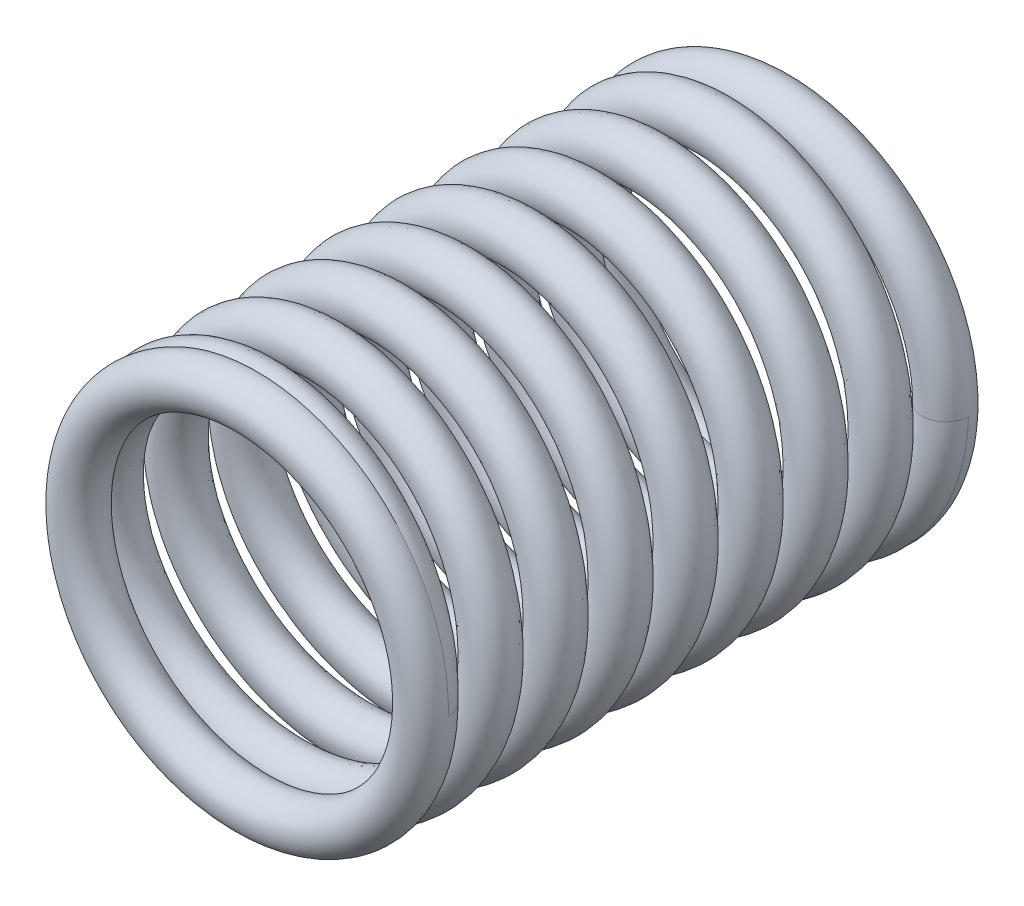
ISO-10303-21;
HEADER;
FILE_DESCRIPTION(('STEP AP214'),'2;1');
FILE_NAME('part.step','',(''),(''),'','','');
FILE_SCHEMA(('AUTOMOTIVE_DESIGN { 1 0 10303 214 1 1 1 1 }'));
ENDSEC;
DATA;
#1=APPLICATION_CONTEXT('core data for automotive mechanical design processes');
#2=APPLICATION_PROTOCOL_DEFINITION('international standard','automotive_design',2000,#1);
#3=PRODUCT_CONTEXT('',#1,'mechanical');
#4=PRODUCT('Part','Part','',(#3));
#5=PRODUCT_RELATED_PRODUCT_CATEGORY('part','',(#4));
#6=PRODUCT_DEFINITION_FORMATION('','',#4);
#7=PRODUCT_DEFINITION_CONTEXT('part definition',#1,'design');
#8=PRODUCT_DEFINITION('design','',#6,#7);
#9=PRODUCT_DEFINITION_SHAPE('','',#8);
#10=(LENGTH_UNIT() NAMED_UNIT(*) SI_UNIT(.MILLI.,.METRE.));
#11=(NAMED_UNIT(*) PLANE_ANGLE_UNIT() SI_UNIT($,.RADIAN.));
#12=(NAMED_UNIT(*) SI_UNIT($,.STERADIAN.) SOLID_ANGLE_UNIT());
#13=UNCERTAINTY_MEASURE_WITH_UNIT(LENGTH_MEASURE(1.E-05),#10,'distance_accuracy_value','');
#14=(GEOMETRIC_REPRESENTATION_CONTEXT(3) GLOBAL_UNCERTAINTY_ASSIGNED_CONTEXT((#13)) GLOBAL_UNIT_ASSIGNED_CONTEXT((#10,
#11,#12)) REPRESENTATION_CONTEXT('',''));
#15=CARTESIAN_POINT('',(0.,0.,0.));
#16=DIRECTION('',(0.,0.,1.));
#17=DIRECTION('',(1.,0.,0.));
#18=AXIS2_PLACEMENT_3D('',#15,#16,#17);
#19=CARTESIAN_POINT('',(3.,0.,-0.162499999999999));
#20=CARTESIAN_POINT('',(3.,-1.73205080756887,-0.0687499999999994));
#21=CARTESIAN_POINT('',(1.50000000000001,-2.59807621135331,0.0250000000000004));
#22=CARTESIAN_POINT('',(0.,-3.46410161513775,0.11875));
#23=CARTESIAN_POINT('',(-1.49999999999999,-2.59807621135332,0.2125));
#24=CARTESIAN_POINT('',(-3.,-1.73205080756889,0.30625));
#25=CARTESIAN_POINT('',(-3.,0.,0.399999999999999));
#26=CARTESIAN_POINT('',(-3.00000000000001,1.73205080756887,0.493749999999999));
#27=CARTESIAN_POINT('',(-1.50000000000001,2.59807621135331,0.587499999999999));
#28=CARTESIAN_POINT('',(0.,3.46410161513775,0.681249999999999));
#29=CARTESIAN_POINT('',(1.49999999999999,2.59807621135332,0.774999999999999));
#30=CARTESIAN_POINT('',(3.,1.73205080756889,0.868749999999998));
#31=CARTESIAN_POINT('',(3.,0.,0.962499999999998));
#32=CARTESIAN_POINT('',(3.,-1.73205080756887,1.05625));
#33=CARTESIAN_POINT('',(1.50000000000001,-2.59807621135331,1.15));
#34=CARTESIAN_POINT('',(0.,-3.46410161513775,1.24375));
#35=CARTESIAN_POINT('',(-1.49999999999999,-2.59807621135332,1.3375));
#36=CARTESIAN_POINT('',(-3.,-1.73205080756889,1.43125));
#37=CARTESIAN_POINT('',(-3.,0.,1.525));
#38=CARTESIAN_POINT('',(-3.00000000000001,1.73205080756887,1.61875));
#39=CARTESIAN_POINT('',(-1.50000000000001,2.59807621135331,1.7125));
#40=CARTESIAN_POINT('',(0.,3.46410161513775,1.80625));
#41=CARTESIAN_POINT('',(1.49999999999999,2.59807621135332,1.9));
#42=CARTESIAN_POINT('',(3.,1.73205080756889,1.99375));
#43=CARTESIAN_POINT('',(3.,0.,2.0875));
#44=CARTESIAN_POINT('',(3.,-1.73205080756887,2.18125));
#45=CARTESIAN_POINT('',(1.50000000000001,-2.59807621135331,2.275));
#46=CARTESIAN_POINT('',(0.,-3.46410161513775,2.36875));
#47=CARTESIAN_POINT('',(-1.49999999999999,-2.59807621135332,2.46249999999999));
#48=CARTESIAN_POINT('',(-3.,-1.73205080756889,2.55624999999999));
#49=CARTESIAN_POINT('',(-3.,0.,2.64999999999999));
#50=CARTESIAN_POINT('',(-3.00000000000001,1.73205080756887,2.74374999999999));
#51=CARTESIAN_POINT('',(-1.50000000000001,2.59807621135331,2.83749999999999));
#52=CARTESIAN_POINT('',(0.,3.46410161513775,2.93124999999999));
#53=CARTESIAN_POINT('',(1.49999999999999,2.59807621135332,3.02499999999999));
#54=CARTESIAN_POINT('',(3.,1.73205080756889,3.11874999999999));
#55=CARTESIAN_POINT('',(3.,0.,3.21249999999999));
#56=CARTESIAN_POINT('',(3.,-1.73205080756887,3.30624999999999));
#57=CARTESIAN_POINT('',(1.50000000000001,-2.59807621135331,3.39999999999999));
#58=CARTESIAN_POINT('',(0.,-3.46410161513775,3.49374999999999));
#59=CARTESIAN_POINT('',(-1.49999999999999,-2.59807621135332,3.58749999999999));
#60=CARTESIAN_POINT('',(-3.,-1.73205080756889,3.68124999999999));
#61=CARTESIAN_POINT('',(-3.,0.,3.77499999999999));
#62=CARTESIAN_POINT('',(-3.00000000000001,1.73205080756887,3.86874999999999));
#63=CARTESIAN_POINT('',(-1.50000000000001,2.59807621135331,3.96249999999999));
#64=CARTESIAN_POINT('',(0.,3.46410161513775,4.05624999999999));
#65=CARTESIAN_POINT('',(1.49999999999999,2.59807621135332,4.14999999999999));
#66=CARTESIAN_POINT('',(3.,1.73205080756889,4.24374999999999));
#67=CARTESIAN_POINT('',(3.,0.,4.33749999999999));
#68=CARTESIAN_POINT('',(3.,-1.73205080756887,4.43124999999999));
#69=CARTESIAN_POINT('',(1.50000000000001,-2.59807621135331,4.52499999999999));
#70=CARTESIAN_POINT('',(0.,-3.46410161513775,4.61874999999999));
#71=CARTESIAN_POINT('',(-1.49999999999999,-2.59807621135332,4.71249999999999));
#72=CARTESIAN_POINT('',(-3.,-1.73205080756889,4.80624999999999));
#73=CARTESIAN_POINT('',(-3.,0.,4.89999999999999));
#74=CARTESIAN_POINT('',(-3.00000000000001,1.73205080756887,4.99374999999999));
#75=CARTESIAN_POINT('',(-1.50000000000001,2.59807621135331,5.08749999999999));
#76=CARTESIAN_POINT('',(0.,3.46410161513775,5.18124999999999));
#77=CARTESIAN_POINT('',(1.49999999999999,2.59807621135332,5.27499999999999));
#78=CARTESIAN_POINT('',(3.,1.73205080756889,5.36874999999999));
#79=CARTESIAN_POINT('',(3.,0.,5.46249999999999));
#80=CARTESIAN_POINT('',(3.,-1.73205080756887,5.55624999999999));
#81=CARTESIAN_POINT('',(1.50000000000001,-2.59807621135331,5.64999999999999));
#82=CARTESIAN_POINT('',(0.,-3.46410161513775,5.74374999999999));
#83=CARTESIAN_POINT('',(-1.49999999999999,-2.59807621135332,5.83749999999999));
#84=CARTESIAN_POINT('',(-3.,-1.73205080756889,5.93124999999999));
#85=CARTESIAN_POINT('',(-3.,0.,6.02499999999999));
#86=CARTESIAN_POINT('',(-3.00000000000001,1.73205080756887,6.11874999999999));
#87=CARTESIAN_POINT('',(-1.50000000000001,2.59807621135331,6.21249999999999));
#88=CARTESIAN_POINT('',(0.,3.46410161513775,6.30624999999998));
#89=CARTESIAN_POINT('',(1.49999999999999,2.59807621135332,6.39999999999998));
#90=CARTESIAN_POINT('',(3.,1.73205080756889,6.49374999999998));
#91=CARTESIAN_POINT('',(3.,0.,6.58749999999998));
#92=CARTESIAN_POINT('',(3.,-1.73205080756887,6.68124999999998));
#93=CARTESIAN_POINT('',(1.50000000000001,-2.59807621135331,6.77499999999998));
#94=CARTESIAN_POINT('',(0.,-3.46410161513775,6.86874999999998));
#95=CARTESIAN_POINT('',(-1.49999999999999,-2.59807621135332,6.96249999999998));
#96=CARTESIAN_POINT('',(-3.,-1.73205080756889,7.05624999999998));
#97=CARTESIAN_POINT('',(-3.,0.,7.14999999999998));
#98=CARTESIAN_POINT('',(-3.00000000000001,1.73205080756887,7.24374999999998));
#99=CARTESIAN_POINT('',(-1.50000000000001,2.59807621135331,7.33749999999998));
#100=CARTESIAN_POINT('',(0.,3.46410161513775,7.43124999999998));
#101=CARTESIAN_POINT('',(1.49999999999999,2.59807621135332,7.52499999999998));
#102=CARTESIAN_POINT('',(3.,1.73205080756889,7.61874999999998));
#103=CARTESIAN_POINT('',(3.,0.,7.71249999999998));
#104=CARTESIAN_POINT('',(3.,-1.73205080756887,7.80624999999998));
#105=CARTESIAN_POINT('',(1.50000000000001,-2.59807621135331,7.89999999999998));
#106=CARTESIAN_POINT('',(0.,-3.46410161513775,7.99374999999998));
#107=CARTESIAN_POINT('',(-1.49999999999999,-2.59807621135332,8.08749999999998));
#108=CARTESIAN_POINT('',(-3.,-1.73205080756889,8.18124999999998));
#109=CARTESIAN_POINT('',(-3.,0.,8.27499999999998));
#110=CARTESIAN_POINT('',(-3.00000000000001,1.73205080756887,8.36874999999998));
#111=CARTESIAN_POINT('',(-1.50000000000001,2.59807621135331,8.46249999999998));
#112=CARTESIAN_POINT('',(0.,3.46410161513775,8.55624999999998));
#113=CARTESIAN_POINT('',(1.49999999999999,2.59807621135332,8.64999999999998));
#114=CARTESIAN_POINT('',(3.,1.73205080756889,8.74374999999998));
#115=CARTESIAN_POINT('',(3.,0.,8.83749999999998));
#116=CARTESIAN_POINT('',(3.,-1.73205080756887,8.93124999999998));
#117=CARTESIAN_POINT('',(1.50000000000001,-2.59807621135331,9.02499999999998));
#118=CARTESIAN_POINT('',(0.,-3.46410161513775,9.11874999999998));
#119=CARTESIAN_POINT('',(-1.49999999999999,-2.59807621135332,9.21249999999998));
#120=CARTESIAN_POINT('',(-3.,-1.73205080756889,9.30624999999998));
#121=CARTESIAN_POINT('',(-3.,0.,9.39999999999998));
#122=CARTESIAN_POINT('',(-3.00000000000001,1.73205080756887,9.49374999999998));
#123=CARTESIAN_POINT('',(-1.50000000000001,2.59807621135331,9.58749999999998));
#124=CARTESIAN_POINT('',(0.,3.46410161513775,9.68124999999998));
#125=CARTESIAN_POINT('',(1.49999999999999,2.59807621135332,9.77499999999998));
#126=CARTESIAN_POINT('',(3.,1.73205080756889,9.86874999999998));
#127=CARTESIAN_POINT('',(3.,0.,9.96249999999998));
#128=CARTESIAN_POINT('',(2.2,0.,-0.162499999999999));
#129=CARTESIAN_POINT('',(2.2,-1.27017059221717,-0.0687499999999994));
#130=CARTESIAN_POINT('',(1.10000000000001,-1.90525588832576,0.0250000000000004));
#131=CARTESIAN_POINT('',(0.,-2.54034118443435,0.11875));
#132=CARTESIAN_POINT('',(-1.09999999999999,-1.90525588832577,0.2125));
#133=CARTESIAN_POINT('',(-2.2,-1.27017059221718,0.30625));
#134=CARTESIAN_POINT('',(-2.2,0.,0.399999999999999));
#135=CARTESIAN_POINT('',(-2.2,1.27017059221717,0.493749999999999));
#136=CARTESIAN_POINT('',(-1.10000000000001,1.90525588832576,0.587499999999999));
#137=CARTESIAN_POINT('',(0.,2.54034118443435,0.681249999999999));
#138=CARTESIAN_POINT('',(1.09999999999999,1.90525588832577,0.774999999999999));
#139=CARTESIAN_POINT('',(2.2,1.27017059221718,0.868749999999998));
#140=CARTESIAN_POINT('',(2.2,0.,0.962499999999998));
#141=CARTESIAN_POINT('',(2.2,-1.27017059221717,1.05625));
#142=CARTESIAN_POINT('',(1.10000000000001,-1.90525588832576,1.15));
#143=CARTESIAN_POINT('',(0.,-2.54034118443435,1.24375));
#144=CARTESIAN_POINT('',(-1.09999999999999,-1.90525588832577,1.3375));
#145=CARTESIAN_POINT('',(-2.2,-1.27017059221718,1.43125));
#146=CARTESIAN_POINT('',(-2.2,0.,1.525));
#147=CARTESIAN_POINT('',(-2.2,1.27017059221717,1.61875));
#148=CARTESIAN_POINT('',(-1.10000000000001,1.90525588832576,1.7125));
#149=CARTESIAN_POINT('',(0.,2.54034118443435,1.80625));
#150=CARTESIAN_POINT('',(1.09999999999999,1.90525588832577,1.9));
#151=CARTESIAN_POINT('',(2.2,1.27017059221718,1.99375));
#152=CARTESIAN_POINT('',(2.2,0.,2.0875));
#153=CARTESIAN_POINT('',(2.2,-1.27017059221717,2.18125));
#154=CARTESIAN_POINT('',(1.10000000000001,-1.90525588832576,2.275));
#155=CARTESIAN_POINT('',(0.,-2.54034118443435,2.36875));
#156=CARTESIAN_POINT('',(-1.09999999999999,-1.90525588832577,2.46249999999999));
#157=CARTESIAN_POINT('',(-2.2,-1.27017059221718,2.55624999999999));
#158=CARTESIAN_POINT('',(-2.2,0.,2.64999999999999));
#159=CARTESIAN_POINT('',(-2.2,1.27017059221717,2.74374999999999));
#160=CARTESIAN_POINT('',(-1.10000000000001,1.90525588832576,2.83749999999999));
#161=CARTESIAN_POINT('',(0.,2.54034118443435,2.93124999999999));
#162=CARTESIAN_POINT('',(1.09999999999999,1.90525588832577,3.02499999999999));
#163=CARTESIAN_POINT('',(2.2,1.27017059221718,3.11874999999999));
#164=CARTESIAN_POINT('',(2.2,0.,3.21249999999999));
#165=CARTESIAN_POINT('',(2.2,-1.27017059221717,3.30624999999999));
#166=CARTESIAN_POINT('',(1.10000000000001,-1.90525588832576,3.39999999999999));
#167=CARTESIAN_POINT('',(0.,-2.54034118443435,3.49374999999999));
#168=CARTESIAN_POINT('',(-1.09999999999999,-1.90525588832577,3.58749999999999));
#169=CARTESIAN_POINT('',(-2.2,-1.27017059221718,3.68124999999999));
#170=CARTESIAN_POINT('',(-2.2,0.,3.77499999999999));
#171=CARTESIAN_POINT('',(-2.2,1.27017059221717,3.86874999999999));
#172=CARTESIAN_POINT('',(-1.10000000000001,1.90525588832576,3.96249999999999));
#173=CARTESIAN_POINT('',(0.,2.54034118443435,4.05624999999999));
#174=CARTESIAN_POINT('',(1.09999999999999,1.90525588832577,4.14999999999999));
#175=CARTESIAN_POINT('',(2.2,1.27017059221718,4.24374999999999));
#176=CARTESIAN_POINT('',(2.2,0.,4.33749999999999));
#177=CARTESIAN_POINT('',(2.2,-1.27017059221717,4.43124999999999));
#178=CARTESIAN_POINT('',(1.10000000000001,-1.90525588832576,4.52499999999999));
#179=CARTESIAN_POINT('',(0.,-2.54034118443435,4.61874999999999));
#180=CARTESIAN_POINT('',(-1.09999999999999,-1.90525588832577,4.71249999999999));
#181=CARTESIAN_POINT('',(-2.2,-1.27017059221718,4.80624999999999));
#182=CARTESIAN_POINT('',(-2.2,0.,4.89999999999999));
#183=CARTESIAN_POINT('',(-2.2,1.27017059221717,4.99374999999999));
#184=CARTESIAN_POINT('',(-1.10000000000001,1.90525588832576,5.08749999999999));
#185=CARTESIAN_POINT('',(0.,2.54034118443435,5.18124999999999));
#186=CARTESIAN_POINT('',(1.09999999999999,1.90525588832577,5.27499999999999));
#187=CARTESIAN_POINT('',(2.2,1.27017059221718,5.36874999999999));
#188=CARTESIAN_POINT('',(2.2,0.,5.46249999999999));
#189=CARTESIAN_POINT('',(2.2,-1.27017059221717,5.55624999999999));
#190=CARTESIAN_POINT('',(1.10000000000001,-1.90525588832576,5.64999999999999));
#191=CARTESIAN_POINT('',(0.,-2.54034118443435,5.74374999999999));
#192=CARTESIAN_POINT('',(-1.09999999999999,-1.90525588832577,5.83749999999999));
#193=CARTESIAN_POINT('',(-2.2,-1.27017059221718,5.93124999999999));
#194=CARTESIAN_POINT('',(-2.2,0.,6.02499999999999));
#195=CARTESIAN_POINT('',(-2.2,1.27017059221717,6.11874999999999));
#196=CARTESIAN_POINT('',(-1.10000000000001,1.90525588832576,6.21249999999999));
#197=CARTESIAN_POINT('',(0.,2.54034118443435,6.30624999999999));
#198=CARTESIAN_POINT('',(1.09999999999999,1.90525588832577,6.39999999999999));
#199=CARTESIAN_POINT('',(2.2,1.27017059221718,6.49374999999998));
#200=CARTESIAN_POINT('',(2.2,0.,6.58749999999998));
#201=CARTESIAN_POINT('',(2.2,-1.27017059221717,6.68124999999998));
#202=CARTESIAN_POINT('',(1.10000000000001,-1.90525588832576,6.77499999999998));
#203=CARTESIAN_POINT('',(0.,-2.54034118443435,6.86874999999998));
#204=CARTESIAN_POINT('',(-1.09999999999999,-1.90525588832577,6.96249999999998));
#205=CARTESIAN_POINT('',(-2.2,-1.27017059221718,7.05624999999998));
#206=CARTESIAN_POINT('',(-2.2,0.,7.14999999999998));
#207=CARTESIAN_POINT('',(-2.2,1.27017059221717,7.24374999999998));
#208=CARTESIAN_POINT('',(-1.10000000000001,1.90525588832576,7.33749999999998));
#209=CARTESIAN_POINT('',(0.,2.54034118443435,7.43124999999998));
#210=CARTESIAN_POINT('',(1.09999999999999,1.90525588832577,7.52499999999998));
#211=CARTESIAN_POINT('',(2.2,1.27017059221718,7.61874999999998));
#212=CARTESIAN_POINT('',(2.2,0.,7.71249999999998));
#213=CARTESIAN_POINT('',(2.2,-1.27017059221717,7.80624999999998));
#214=CARTESIAN_POINT('',(1.10000000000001,-1.90525588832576,7.89999999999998));
#215=CARTESIAN_POINT('',(0.,-2.54034118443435,7.99374999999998));
#216=CARTESIAN_POINT('',(-1.09999999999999,-1.90525588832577,8.08749999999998));
#217=CARTESIAN_POINT('',(-2.2,-1.27017059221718,8.18124999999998));
#218=CARTESIAN_POINT('',(-2.2,0.,8.27499999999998));
#219=CARTESIAN_POINT('',(-2.2,1.27017059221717,8.36874999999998));
#220=CARTESIAN_POINT('',(-1.10000000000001,1.90525588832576,8.46249999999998));
#221=CARTESIAN_POINT('',(0.,2.54034118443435,8.55624999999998));
#222=CARTESIAN_POINT('',(1.09999999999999,1.90525588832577,8.64999999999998));
#223=CARTESIAN_POINT('',(2.2,1.27017059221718,8.74374999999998));
#224=CARTESIAN_POINT('',(2.2,0.,8.83749999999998));
#225=CARTESIAN_POINT('',(2.2,-1.27017059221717,8.93124999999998));
#226=CARTESIAN_POINT('',(1.10000000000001,-1.90525588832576,9.02499999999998));
#227=CARTESIAN_POINT('',(0.,-2.54034118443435,9.11874999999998));
#228=CARTESIAN_POINT('',(-1.09999999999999,-1.90525588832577,9.21249999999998));
#229=CARTESIAN_POINT('',(-2.2,-1.27017059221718,9.30624999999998));
#230=CARTESIAN_POINT('',(-2.2,0.,9.39999999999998));
#231=CARTESIAN_POINT('',(-2.2,1.27017059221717,9.49374999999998));
#232=CARTESIAN_POINT('',(-1.10000000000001,1.90525588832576,9.58749999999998));
#233=CARTESIAN_POINT('',(0.,2.54034118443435,9.68124999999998));
#234=CARTESIAN_POINT('',(1.09999999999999,1.90525588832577,9.77499999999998));
#235=CARTESIAN_POINT('',(2.2,1.27017059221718,9.86874999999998));
#236=CARTESIAN_POINT('',(2.2,0.,9.96249999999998));
#237=CARTESIAN_POINT('',(2.2,0.,-0.962499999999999));
#238=CARTESIAN_POINT('',(2.2,-1.27017059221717,-0.868749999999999));
#239=CARTESIAN_POINT('',(1.10000000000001,-1.90525588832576,-0.775));
#240=CARTESIAN_POINT('',(0.,-2.54034118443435,-0.68125));
#241=CARTESIAN_POINT('',(-1.09999999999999,-1.90525588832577,-0.5875));
#242=CARTESIAN_POINT('',(-2.2,-1.27017059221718,-0.49375));
#243=CARTESIAN_POINT('',(-2.2,0.,-0.400000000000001));
#244=CARTESIAN_POINT('',(-2.2,1.27017059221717,-0.306250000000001));
#245=CARTESIAN_POINT('',(-1.10000000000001,1.90525588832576,-0.212500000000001));
#246=CARTESIAN_POINT('',(0.,2.54034118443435,-0.118750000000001));
#247=CARTESIAN_POINT('',(1.09999999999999,1.90525588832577,-0.0250000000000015));
#248=CARTESIAN_POINT('',(2.2,1.27017059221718,0.0687499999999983));
#249=CARTESIAN_POINT('',(2.2,0.,0.162499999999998));
#250=CARTESIAN_POINT('',(2.2,-1.27017059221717,0.256249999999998));
#251=CARTESIAN_POINT('',(1.10000000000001,-1.90525588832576,0.349999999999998));
#252=CARTESIAN_POINT('',(0.,-2.54034118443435,0.443749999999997));
#253=CARTESIAN_POINT('',(-1.09999999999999,-1.90525588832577,0.537499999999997));
#254=CARTESIAN_POINT('',(-2.2,-1.27017059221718,0.631249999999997));
#255=CARTESIAN_POINT('',(-2.2,0.,0.724999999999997));
#256=CARTESIAN_POINT('',(-2.2,1.27017059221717,0.818749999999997));
#257=CARTESIAN_POINT('',(-1.10000000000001,1.90525588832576,0.912499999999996));
#258=CARTESIAN_POINT('',(0.,2.54034118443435,1.00625));
#259=CARTESIAN_POINT('',(1.09999999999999,1.90525588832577,1.1));
#260=CARTESIAN_POINT('',(2.2,1.27017059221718,1.19375));
#261=CARTESIAN_POINT('',(2.2,0.,1.2875));
#262=CARTESIAN_POINT('',(2.2,-1.27017059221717,1.38125));
#263=CARTESIAN_POINT('',(1.10000000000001,-1.90525588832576,1.47499999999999));
#264=CARTESIAN_POINT('',(0.,-2.54034118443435,1.56874999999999));
#265=CARTESIAN_POINT('',(-1.09999999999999,-1.90525588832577,1.66249999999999));
#266=CARTESIAN_POINT('',(-2.2,-1.27017059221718,1.75624999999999));
#267=CARTESIAN_POINT('',(-2.2,0.,1.84999999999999));
#268=CARTESIAN_POINT('',(-2.2,1.27017059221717,1.94374999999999));
#269=CARTESIAN_POINT('',(-1.10000000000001,1.90525588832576,2.03749999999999));
#270=CARTESIAN_POINT('',(0.,2.54034118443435,2.13124999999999));
#271=CARTESIAN_POINT('',(1.09999999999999,1.90525588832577,2.22499999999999));
#272=CARTESIAN_POINT('',(2.2,1.27017059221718,2.31874999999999));
#273=CARTESIAN_POINT('',(2.2,0.,2.41249999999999));
#274=CARTESIAN_POINT('',(2.2,-1.27017059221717,2.50624999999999));
#275=CARTESIAN_POINT('',(1.10000000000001,-1.90525588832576,2.59999999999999));
#276=CARTESIAN_POINT('',(0.,-2.54034118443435,2.69374999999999));
#277=CARTESIAN_POINT('',(-1.09999999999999,-1.90525588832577,2.78749999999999));
#278=CARTESIAN_POINT('',(-2.2,-1.27017059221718,2.88124999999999));
#279=CARTESIAN_POINT('',(-2.2,0.,2.97499999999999));
#280=CARTESIAN_POINT('',(-2.2,1.27017059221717,3.06874999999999));
#281=CARTESIAN_POINT('',(-1.10000000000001,1.90525588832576,3.16249999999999));
#282=CARTESIAN_POINT('',(0.,2.54034118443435,3.25624999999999));
#283=CARTESIAN_POINT('',(1.09999999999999,1.90525588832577,3.34999999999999));
#284=CARTESIAN_POINT('',(2.2,1.27017059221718,3.44374999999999));
#285=CARTESIAN_POINT('',(2.2,0.,3.53749999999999));
#286=CARTESIAN_POINT('',(2.2,-1.27017059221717,3.63124999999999));
#287=CARTESIAN_POINT('',(1.10000000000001,-1.90525588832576,3.72499999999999));
#288=CARTESIAN_POINT('',(0.,-2.54034118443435,3.81874999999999));
#289=CARTESIAN_POINT('',(-1.09999999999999,-1.90525588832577,3.91249999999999));
#290=CARTESIAN_POINT('',(-2.2,-1.27017059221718,4.00624999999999));
#291=CARTESIAN_POINT('',(-2.2,0.,4.09999999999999));
#292=CARTESIAN_POINT('',(-2.2,1.27017059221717,4.19374999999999));
#293=CARTESIAN_POINT('',(-1.10000000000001,1.90525588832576,4.28749999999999));
#294=CARTESIAN_POINT('',(0.,2.54034118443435,4.38124999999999));
#295=CARTESIAN_POINT('',(1.09999999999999,1.90525588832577,4.47499999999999));
#296=CARTESIAN_POINT('',(2.2,1.27017059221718,4.56874999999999));
#297=CARTESIAN_POINT('',(2.2,0.,4.66249999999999));
#298=CARTESIAN_POINT('',(2.2,-1.27017059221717,4.75624999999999));
#299=CARTESIAN_POINT('',(1.10000000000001,-1.90525588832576,4.84999999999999));
#300=CARTESIAN_POINT('',(0.,-2.54034118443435,4.94374999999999));
#301=CARTESIAN_POINT('',(-1.09999999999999,-1.90525588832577,5.03749999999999));
#302=CARTESIAN_POINT('',(-2.2,-1.27017059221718,5.13124999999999));
#303=CARTESIAN_POINT('',(-2.2,0.,5.22499999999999));
#304=CARTESIAN_POINT('',(-2.2,1.27017059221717,5.31874999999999));
#305=CARTESIAN_POINT('',(-1.10000000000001,1.90525588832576,5.41249999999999));
#306=CARTESIAN_POINT('',(0.,2.54034118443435,5.50624999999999));
#307=CARTESIAN_POINT('',(1.09999999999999,1.90525588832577,5.59999999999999));
#308=CARTESIAN_POINT('',(2.2,1.27017059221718,5.69374999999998));
#309=CARTESIAN_POINT('',(2.2,0.,5.78749999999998));
#310=CARTESIAN_POINT('',(2.2,-1.27017059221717,5.88124999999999));
#311=CARTESIAN_POINT('',(1.10000000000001,-1.90525588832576,5.97499999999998));
#312=CARTESIAN_POINT('',(0.,-2.54034118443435,6.06874999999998));
#313=CARTESIAN_POINT('',(-1.09999999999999,-1.90525588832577,6.16249999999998));
#314=CARTESIAN_POINT('',(-2.2,-1.27017059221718,6.25624999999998));
#315=CARTESIAN_POINT('',(-2.2,0.,6.34999999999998));
#316=CARTESIAN_POINT('',(-2.2,1.27017059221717,6.44374999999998));
#317=CARTESIAN_POINT('',(-1.10000000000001,1.90525588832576,6.53749999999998));
#318=CARTESIAN_POINT('',(0.,2.54034118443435,6.63124999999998));
#319=CARTESIAN_POINT('',(1.09999999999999,1.90525588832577,6.72499999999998));
#320=CARTESIAN_POINT('',(2.2,1.27017059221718,6.81874999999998));
#321=CARTESIAN_POINT('',(2.2,0.,6.91249999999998));
#322=CARTESIAN_POINT('',(2.2,-1.27017059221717,7.00624999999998));
#323=CARTESIAN_POINT('',(1.10000000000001,-1.90525588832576,7.09999999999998));
#324=CARTESIAN_POINT('',(0.,-2.54034118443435,7.19374999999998));
#325=CARTESIAN_POINT('',(-1.09999999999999,-1.90525588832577,7.28749999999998));
#326=CARTESIAN_POINT('',(-2.2,-1.27017059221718,7.38124999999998));
#327=CARTESIAN_POINT('',(-2.2,0.,7.47499999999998));
#328=CARTESIAN_POINT('',(-2.2,1.27017059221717,7.56874999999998));
#329=CARTESIAN_POINT('',(-1.10000000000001,1.90525588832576,7.66249999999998));
#330=CARTESIAN_POINT('',(0.,2.54034118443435,7.75624999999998));
#331=CARTESIAN_POINT('',(1.09999999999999,1.90525588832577,7.84999999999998));
#332=CARTESIAN_POINT('',(2.2,1.27017059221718,7.94374999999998));
#333=CARTESIAN_POINT('',(2.2,0.,8.03749999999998));
#334=CARTESIAN_POINT('',(2.2,-1.27017059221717,8.13124999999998));
#335=CARTESIAN_POINT('',(1.10000000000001,-1.90525588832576,8.22499999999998));
#336=CARTESIAN_POINT('',(0.,-2.54034118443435,8.31874999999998));
#337=CARTESIAN_POINT('',(-1.09999999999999,-1.90525588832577,8.41249999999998));
#338=CARTESIAN_POINT('',(-2.2,-1.27017059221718,8.50624999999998));
#339=CARTESIAN_POINT('',(-2.2,0.,8.59999999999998));
#340=CARTESIAN_POINT('',(-2.2,1.27017059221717,8.69374999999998));
#341=CARTESIAN_POINT('',(-1.10000000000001,1.90525588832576,8.78749999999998));
#342=CARTESIAN_POINT('',(0.,2.54034118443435,8.88124999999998));
#343=CARTESIAN_POINT('',(1.09999999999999,1.90525588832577,8.97499999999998));
#344=CARTESIAN_POINT('',(2.2,1.27017059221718,9.06874999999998));
#345=CARTESIAN_POINT('',(2.2,0.,9.16249999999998));
#346=CARTESIAN_POINT('',(3.,0.,-0.962499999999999));
#347=CARTESIAN_POINT('',(3.,-1.73205080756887,-0.868749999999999));
#348=CARTESIAN_POINT('',(1.50000000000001,-2.59807621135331,-0.775));
#349=CARTESIAN_POINT('',(0.,-3.46410161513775,-0.68125));
#350=CARTESIAN_POINT('',(-1.49999999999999,-2.59807621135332,-0.5875));
#351=CARTESIAN_POINT('',(-3.,-1.73205080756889,-0.49375));
#352=CARTESIAN_POINT('',(-3.,0.,-0.400000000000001));
#353=CARTESIAN_POINT('',(-3.00000000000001,1.73205080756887,-0.306250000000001));
#354=CARTESIAN_POINT('',(-1.50000000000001,2.59807621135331,-0.212500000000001));
#355=CARTESIAN_POINT('',(0.,3.46410161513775,-0.118750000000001));
#356=CARTESIAN_POINT('',(1.49999999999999,2.59807621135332,-0.0250000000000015));
#357=CARTESIAN_POINT('',(3.,1.73205080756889,0.0687499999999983));
#358=CARTESIAN_POINT('',(3.,0.,0.162499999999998));
#359=CARTESIAN_POINT('',(3.,-1.73205080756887,0.256249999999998));
#360=CARTESIAN_POINT('',(1.50000000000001,-2.59807621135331,0.349999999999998));
#361=CARTESIAN_POINT('',(0.,-3.46410161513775,0.443749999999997));
#362=CARTESIAN_POINT('',(-1.49999999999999,-2.59807621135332,0.537499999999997));
#363=CARTESIAN_POINT('',(-3.,-1.73205080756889,0.631249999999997));
#364=CARTESIAN_POINT('',(-3.,0.,0.724999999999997));
#365=CARTESIAN_POINT('',(-3.00000000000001,1.73205080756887,0.818749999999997));
#366=CARTESIAN_POINT('',(-1.50000000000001,2.59807621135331,0.912499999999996));
#367=CARTESIAN_POINT('',(0.,3.46410161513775,1.00625));
#368=CARTESIAN_POINT('',(1.49999999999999,2.59807621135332,1.1));
#369=CARTESIAN_POINT('',(3.,1.73205080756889,1.19375));
#370=CARTESIAN_POINT('',(3.,0.,1.2875));
#371=CARTESIAN_POINT('',(3.,-1.73205080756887,1.38125));
#372=CARTESIAN_POINT('',(1.50000000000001,-2.59807621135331,1.47499999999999));
#373=CARTESIAN_POINT('',(0.,-3.46410161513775,1.56874999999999));
#374=CARTESIAN_POINT('',(-1.49999999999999,-2.59807621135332,1.66249999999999));
#375=CARTESIAN_POINT('',(-3.,-1.73205080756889,1.75624999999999));
#376=CARTESIAN_POINT('',(-3.,0.,1.84999999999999));
#377=CARTESIAN_POINT('',(-3.00000000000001,1.73205080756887,1.94374999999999));
#378=CARTESIAN_POINT('',(-1.50000000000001,2.59807621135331,2.03749999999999));
#379=CARTESIAN_POINT('',(0.,3.46410161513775,2.13124999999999));
#380=CARTESIAN_POINT('',(1.49999999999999,2.59807621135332,2.22499999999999));
#381=CARTESIAN_POINT('',(3.,1.73205080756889,2.31874999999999));
#382=CARTESIAN_POINT('',(3.,0.,2.41249999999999));
#383=CARTESIAN_POINT('',(3.,-1.73205080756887,2.50624999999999));
#384=CARTESIAN_POINT('',(1.50000000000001,-2.59807621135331,2.59999999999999));
#385=CARTESIAN_POINT('',(0.,-3.46410161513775,2.69374999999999));
#386=CARTESIAN_POINT('',(-1.49999999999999,-2.59807621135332,2.78749999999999));
#387=CARTESIAN_POINT('',(-3.,-1.73205080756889,2.88124999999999));
#388=CARTESIAN_POINT('',(-3.,0.,2.97499999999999));
#389=CARTESIAN_POINT('',(-3.00000000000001,1.73205080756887,3.06874999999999));
#390=CARTESIAN_POINT('',(-1.50000000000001,2.59807621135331,3.16249999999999));
#391=CARTESIAN_POINT('',(0.,3.46410161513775,3.25624999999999));
#392=CARTESIAN_POINT('',(1.49999999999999,2.59807621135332,3.34999999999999));
#393=CARTESIAN_POINT('',(3.,1.73205080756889,3.44374999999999));
#394=CARTESIAN_POINT('',(3.,0.,3.53749999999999));
#395=CARTESIAN_POINT('',(3.,-1.73205080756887,3.63124999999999));
#396=CARTESIAN_POINT('',(1.50000000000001,-2.59807621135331,3.72499999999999));
#397=CARTESIAN_POINT('',(0.,-3.46410161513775,3.81874999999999));
#398=CARTESIAN_POINT('',(-1.49999999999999,-2.59807621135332,3.91249999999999));
#399=CARTESIAN_POINT('',(-3.,-1.73205080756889,4.00624999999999));
#400=CARTESIAN_POINT('',(-3.,0.,4.09999999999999));
#401=CARTESIAN_POINT('',(-3.00000000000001,1.73205080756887,4.19374999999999));
#402=CARTESIAN_POINT('',(-1.50000000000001,2.59807621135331,4.28749999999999));
#403=CARTESIAN_POINT('',(0.,3.46410161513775,4.38124999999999));
#404=CARTESIAN_POINT('',(1.49999999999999,2.59807621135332,4.47499999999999));
#405=CARTESIAN_POINT('',(3.,1.73205080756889,4.56874999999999));
#406=CARTESIAN_POINT('',(3.,0.,4.66249999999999));
#407=CARTESIAN_POINT('',(3.,-1.73205080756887,4.75624999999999));
#408=CARTESIAN_POINT('',(1.50000000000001,-2.59807621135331,4.84999999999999));
#409=CARTESIAN_POINT('',(0.,-3.46410161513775,4.94374999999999));
#410=CARTESIAN_POINT('',(-1.49999999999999,-2.59807621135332,5.03749999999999));
#411=CARTESIAN_POINT('',(-3.,-1.73205080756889,5.13124999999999));
#412=CARTESIAN_POINT('',(-3.,0.,5.22499999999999));
#413=CARTESIAN_POINT('',(-3.00000000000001,1.73205080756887,5.31874999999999));
#414=CARTESIAN_POINT('',(-1.50000000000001,2.59807621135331,5.41249999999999));
#415=CARTESIAN_POINT('',(0.,3.46410161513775,5.50624999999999));
#416=CARTESIAN_POINT('',(1.49999999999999,2.59807621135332,5.59999999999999));
#417=CARTESIAN_POINT('',(3.,1.73205080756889,5.69374999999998));
#418=CARTESIAN_POINT('',(3.,0.,5.78749999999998));
#419=CARTESIAN_POINT('',(3.,-1.73205080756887,5.88124999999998));
#420=CARTESIAN_POINT('',(1.50000000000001,-2.59807621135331,5.97499999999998));
#421=CARTESIAN_POINT('',(0.,-3.46410161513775,6.06874999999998));
#422=CARTESIAN_POINT('',(-1.49999999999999,-2.59807621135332,6.16249999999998));
#423=CARTESIAN_POINT('',(-3.,-1.73205080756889,6.25624999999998));
#424=CARTESIAN_POINT('',(-3.,0.,6.34999999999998));
#425=CARTESIAN_POINT('',(-3.00000000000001,1.73205080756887,6.44374999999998));
#426=CARTESIAN_POINT('',(-1.50000000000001,2.59807621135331,6.53749999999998));
#427=CARTESIAN_POINT('',(0.,3.46410161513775,6.63124999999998));
#428=CARTESIAN_POINT('',(1.49999999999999,2.59807621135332,6.72499999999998));
#429=CARTESIAN_POINT('',(3.,1.73205080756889,6.81874999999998));
#430=CARTESIAN_POINT('',(3.,0.,6.91249999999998));
#431=CARTESIAN_POINT('',(3.,-1.73205080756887,7.00624999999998));
#432=CARTESIAN_POINT('',(1.50000000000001,-2.59807621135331,7.09999999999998));
#433=CARTESIAN_POINT('',(0.,-3.46410161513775,7.19374999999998));
#434=CARTESIAN_POINT('',(-1.49999999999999,-2.59807621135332,7.28749999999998));
#435=CARTESIAN_POINT('',(-3.,-1.73205080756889,7.38124999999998));
#436=CARTESIAN_POINT('',(-3.,0.,7.47499999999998));
#437=CARTESIAN_POINT('',(-3.00000000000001,1.73205080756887,7.56874999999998));
#438=CARTESIAN_POINT('',(-1.50000000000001,2.59807621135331,7.66249999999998));
#439=CARTESIAN_POINT('',(0.,3.46410161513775,7.75624999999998));
#440=CARTESIAN_POINT('',(1.49999999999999,2.59807621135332,7.84999999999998));
#441=CARTESIAN_POINT('',(3.,1.73205080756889,7.94374999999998));
#442=CARTESIAN_POINT('',(3.,0.,8.03749999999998));
#443=CARTESIAN_POINT('',(3.,-1.73205080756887,8.13124999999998));
#444=CARTESIAN_POINT('',(1.50000000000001,-2.59807621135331,8.22499999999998));
#445=CARTESIAN_POINT('',(0.,-3.46410161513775,8.31874999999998));
#446=CARTESIAN_POINT('',(-1.49999999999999,-2.59807621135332,8.41249999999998));
#447=CARTESIAN_POINT('',(-3.,-1.73205080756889,8.50624999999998));
#448=CARTESIAN_POINT('',(-3.,0.,8.59999999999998));
#449=CARTESIAN_POINT('',(-3.00000000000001,1.73205080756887,8.69374999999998));
#450=CARTESIAN_POINT('',(-1.50000000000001,2.59807621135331,8.78749999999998));
#451=CARTESIAN_POINT('',(0.,3.46410161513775,8.88124999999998));
#452=CARTESIAN_POINT('',(1.49999999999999,2.59807621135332,8.97499999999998));
#453=CARTESIAN_POINT('',(3.,1.73205080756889,9.06874999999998));
#454=CARTESIAN_POINT('',(3.,0.,9.16249999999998));
#455=CARTESIAN_POINT('',(3.8,0.,-0.962499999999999));
#456=CARTESIAN_POINT('',(3.80000000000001,-2.19393102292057,-0.86875));
#457=CARTESIAN_POINT('',(1.90000000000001,-3.29089653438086,-0.775));
#458=CARTESIAN_POINT('',(0.,-4.38786204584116,-0.68125));
#459=CARTESIAN_POINT('',(-1.89999999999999,-3.29089653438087,-0.5875));
#460=CARTESIAN_POINT('',(-3.79999999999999,-2.19393102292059,-0.49375));
#461=CARTESIAN_POINT('',(-3.8,0.,-0.400000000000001));
#462=CARTESIAN_POINT('',(-3.80000000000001,2.19393102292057,-0.306250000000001));
#463=CARTESIAN_POINT('',(-1.90000000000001,3.29089653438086,-0.212500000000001));
#464=CARTESIAN_POINT('',(0.,4.38786204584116,-0.118750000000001));
#465=CARTESIAN_POINT('',(1.89999999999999,3.29089653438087,-0.0250000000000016));
#466=CARTESIAN_POINT('',(3.79999999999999,2.19393102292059,0.0687499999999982));
#467=CARTESIAN_POINT('',(3.8,0.,0.162499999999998));
#468=CARTESIAN_POINT('',(3.80000000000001,-2.19393102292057,0.256249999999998));
#469=CARTESIAN_POINT('',(1.90000000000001,-3.29089653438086,0.349999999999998));
#470=CARTESIAN_POINT('',(0.,-4.38786204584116,0.443749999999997));
#471=CARTESIAN_POINT('',(-1.89999999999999,-3.29089653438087,0.537499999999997));
#472=CARTESIAN_POINT('',(-3.79999999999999,-2.19393102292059,0.631249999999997));
#473=CARTESIAN_POINT('',(-3.8,0.,0.724999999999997));
#474=CARTESIAN_POINT('',(-3.80000000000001,2.19393102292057,0.818749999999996));
#475=CARTESIAN_POINT('',(-1.90000000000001,3.29089653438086,0.912499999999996));
#476=CARTESIAN_POINT('',(0.,4.38786204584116,1.00625));
#477=CARTESIAN_POINT('',(1.89999999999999,3.29089653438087,1.1));
#478=CARTESIAN_POINT('',(3.79999999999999,2.19393102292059,1.19375));
#479=CARTESIAN_POINT('',(3.8,0.,1.2875));
#480=CARTESIAN_POINT('',(3.80000000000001,-2.19393102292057,1.38124999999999));
#481=CARTESIAN_POINT('',(1.90000000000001,-3.29089653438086,1.47499999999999));
#482=CARTESIAN_POINT('',(0.,-4.38786204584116,1.56874999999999));
#483=CARTESIAN_POINT('',(-1.89999999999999,-3.29089653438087,1.66249999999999));
#484=CARTESIAN_POINT('',(-3.79999999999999,-2.19393102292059,1.75624999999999));
#485=CARTESIAN_POINT('',(-3.8,0.,1.84999999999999));
#486=CARTESIAN_POINT('',(-3.80000000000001,2.19393102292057,1.94374999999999));
#487=CARTESIAN_POINT('',(-1.90000000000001,3.29089653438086,2.03749999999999));
#488=CARTESIAN_POINT('',(0.,4.38786204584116,2.13124999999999));
#489=CARTESIAN_POINT('',(1.89999999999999,3.29089653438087,2.22499999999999));
#490=CARTESIAN_POINT('',(3.79999999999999,2.19393102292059,2.31874999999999));
#491=CARTESIAN_POINT('',(3.8,0.,2.41249999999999));
#492=CARTESIAN_POINT('',(3.80000000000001,-2.19393102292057,2.50624999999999));
#493=CARTESIAN_POINT('',(1.90000000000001,-3.29089653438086,2.59999999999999));
#494=CARTESIAN_POINT('',(0.,-4.38786204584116,2.69374999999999));
#495=CARTESIAN_POINT('',(-1.89999999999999,-3.29089653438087,2.78749999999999));
#496=CARTESIAN_POINT('',(-3.79999999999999,-2.19393102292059,2.88124999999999));
#497=CARTESIAN_POINT('',(-3.8,0.,2.97499999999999));
#498=CARTESIAN_POINT('',(-3.80000000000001,2.19393102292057,3.06874999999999));
#499=CARTESIAN_POINT('',(-1.90000000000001,3.29089653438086,3.16249999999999));
#500=CARTESIAN_POINT('',(0.,4.38786204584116,3.25624999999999));
#501=CARTESIAN_POINT('',(1.89999999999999,3.29089653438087,3.34999999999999));
#502=CARTESIAN_POINT('',(3.79999999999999,2.19393102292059,3.44374999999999));
#503=CARTESIAN_POINT('',(3.8,0.,3.53749999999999));
#504=CARTESIAN_POINT('',(3.80000000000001,-2.19393102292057,3.63124999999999));
#505=CARTESIAN_POINT('',(1.90000000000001,-3.29089653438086,3.72499999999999));
#506=CARTESIAN_POINT('',(0.,-4.38786204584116,3.81874999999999));
#507=CARTESIAN_POINT('',(-1.89999999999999,-3.29089653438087,3.91249999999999));
#508=CARTESIAN_POINT('',(-3.79999999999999,-2.19393102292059,4.00624999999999));
#509=CARTESIAN_POINT('',(-3.8,0.,4.09999999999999));
#510=CARTESIAN_POINT('',(-3.80000000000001,2.19393102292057,4.19374999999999));
#511=CARTESIAN_POINT('',(-1.90000000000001,3.29089653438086,4.28749999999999));
#512=CARTESIAN_POINT('',(0.,4.38786204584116,4.38124999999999));
#513=CARTESIAN_POINT('',(1.89999999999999,3.29089653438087,4.47499999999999));
#514=CARTESIAN_POINT('',(3.79999999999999,2.19393102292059,4.56874999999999));
#515=CARTESIAN_POINT('',(3.8,0.,4.66249999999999));
#516=CARTESIAN_POINT('',(3.80000000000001,-2.19393102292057,4.75624999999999));
#517=CARTESIAN_POINT('',(1.90000000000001,-3.29089653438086,4.84999999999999));
#518=CARTESIAN_POINT('',(0.,-4.38786204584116,4.94374999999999));
#519=CARTESIAN_POINT('',(-1.89999999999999,-3.29089653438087,5.03749999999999));
#520=CARTESIAN_POINT('',(-3.79999999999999,-2.19393102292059,5.13124999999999));
#521=CARTESIAN_POINT('',(-3.8,0.,5.22499999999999));
#522=CARTESIAN_POINT('',(-3.80000000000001,2.19393102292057,5.31874999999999));
#523=CARTESIAN_POINT('',(-1.90000000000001,3.29089653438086,5.41249999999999));
#524=CARTESIAN_POINT('',(0.,4.38786204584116,5.50624999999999));
#525=CARTESIAN_POINT('',(1.89999999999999,3.29089653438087,5.59999999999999));
#526=CARTESIAN_POINT('',(3.79999999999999,2.19393102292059,5.69374999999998));
#527=CARTESIAN_POINT('',(3.8,0.,5.78749999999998));
#528=CARTESIAN_POINT('',(3.80000000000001,-2.19393102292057,5.88124999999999));
#529=CARTESIAN_POINT('',(1.90000000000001,-3.29089653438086,5.97499999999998));
#530=CARTESIAN_POINT('',(0.,-4.38786204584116,6.06874999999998));
#531=CARTESIAN_POINT('',(-1.89999999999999,-3.29089653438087,6.16249999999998));
#532=CARTESIAN_POINT('',(-3.79999999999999,-2.19393102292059,6.25624999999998));
#533=CARTESIAN_POINT('',(-3.8,0.,6.34999999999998));
#534=CARTESIAN_POINT('',(-3.80000000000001,2.19393102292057,6.44374999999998));
#535=CARTESIAN_POINT('',(-1.90000000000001,3.29089653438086,6.53749999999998));
#536=CARTESIAN_POINT('',(0.,4.38786204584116,6.63124999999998));
#537=CARTESIAN_POINT('',(1.89999999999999,3.29089653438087,6.72499999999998));
#538=CARTESIAN_POINT('',(3.79999999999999,2.19393102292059,6.81874999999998));
#539=CARTESIAN_POINT('',(3.8,0.,6.91249999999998));
#540=CARTESIAN_POINT('',(3.80000000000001,-2.19393102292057,7.00624999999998));
#541=CARTESIAN_POINT('',(1.90000000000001,-3.29089653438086,7.09999999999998));
#542=CARTESIAN_POINT('',(0.,-4.38786204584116,7.19374999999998));
#543=CARTESIAN_POINT('',(-1.89999999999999,-3.29089653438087,7.28749999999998));
#544=CARTESIAN_POINT('',(-3.79999999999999,-2.19393102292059,7.38124999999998));
#545=CARTESIAN_POINT('',(-3.8,0.,7.47499999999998));
#546=CARTESIAN_POINT('',(-3.80000000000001,2.19393102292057,7.56874999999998));
#547=CARTESIAN_POINT('',(-1.90000000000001,3.29089653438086,7.66249999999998));
#548=CARTESIAN_POINT('',(0.,4.38786204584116,7.75624999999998));
#549=CARTESIAN_POINT('',(1.89999999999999,3.29089653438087,7.84999999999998));
#550=CARTESIAN_POINT('',(3.79999999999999,2.19393102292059,7.94374999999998));
#551=CARTESIAN_POINT('',(3.8,0.,8.03749999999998));
#552=CARTESIAN_POINT('',(3.80000000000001,-2.19393102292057,8.13124999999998));
#553=CARTESIAN_POINT('',(1.90000000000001,-3.29089653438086,8.22499999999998));
#554=CARTESIAN_POINT('',(0.,-4.38786204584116,8.31874999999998));
#555=CARTESIAN_POINT('',(-1.89999999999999,-3.29089653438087,8.41249999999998));
#556=CARTESIAN_POINT('',(-3.79999999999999,-2.19393102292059,8.50624999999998));
#557=CARTESIAN_POINT('',(-3.8,0.,8.59999999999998));
#558=CARTESIAN_POINT('',(-3.80000000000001,2.19393102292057,8.69374999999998));
#559=CARTESIAN_POINT('',(-1.90000000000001,3.29089653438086,8.78749999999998));
#560=CARTESIAN_POINT('',(0.,4.38786204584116,8.88124999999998));
#561=CARTESIAN_POINT('',(1.89999999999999,3.29089653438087,8.97499999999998));
#562=CARTESIAN_POINT('',(3.79999999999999,2.19393102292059,9.06874999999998));
#563=CARTESIAN_POINT('',(3.8,0.,9.16249999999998));
#564=CARTESIAN_POINT('',(3.8,0.,-0.162499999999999));
#565=CARTESIAN_POINT('',(3.80000000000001,-2.19393102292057,-0.0687499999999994));
#566=CARTESIAN_POINT('',(1.90000000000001,-3.29089653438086,0.0250000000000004));
#567=CARTESIAN_POINT('',(0.,-4.38786204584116,0.11875));
#568=CARTESIAN_POINT('',(-1.89999999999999,-3.29089653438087,0.2125));
#569=CARTESIAN_POINT('',(-3.79999999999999,-2.19393102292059,0.30625));
#570=CARTESIAN_POINT('',(-3.8,0.,0.399999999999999));
#571=CARTESIAN_POINT('',(-3.80000000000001,2.19393102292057,0.493749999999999));
#572=CARTESIAN_POINT('',(-1.90000000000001,3.29089653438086,0.587499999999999));
#573=CARTESIAN_POINT('',(0.,4.38786204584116,0.681249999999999));
#574=CARTESIAN_POINT('',(1.89999999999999,3.29089653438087,0.774999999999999));
#575=CARTESIAN_POINT('',(3.79999999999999,2.19393102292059,0.868749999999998));
#576=CARTESIAN_POINT('',(3.8,0.,0.962499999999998));
#577=CARTESIAN_POINT('',(3.80000000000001,-2.19393102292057,1.05625));
#578=CARTESIAN_POINT('',(1.90000000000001,-3.29089653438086,1.15));
#579=CARTESIAN_POINT('',(0.,-4.38786204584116,1.24375));
#580=CARTESIAN_POINT('',(-1.89999999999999,-3.29089653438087,1.3375));
#581=CARTESIAN_POINT('',(-3.79999999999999,-2.19393102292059,1.43125));
#582=CARTESIAN_POINT('',(-3.8,0.,1.525));
#583=CARTESIAN_POINT('',(-3.80000000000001,2.19393102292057,1.61875));
#584=CARTESIAN_POINT('',(-1.90000000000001,3.29089653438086,1.7125));
#585=CARTESIAN_POINT('',(0.,4.38786204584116,1.80625));
#586=CARTESIAN_POINT('',(1.89999999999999,3.29089653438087,1.9));
#587=CARTESIAN_POINT('',(3.79999999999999,2.19393102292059,1.99375));
#588=CARTESIAN_POINT('',(3.8,0.,2.0875));
#589=CARTESIAN_POINT('',(3.80000000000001,-2.19393102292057,2.18125));
#590=CARTESIAN_POINT('',(1.90000000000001,-3.29089653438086,2.275));
#591=CARTESIAN_POINT('',(0.,-4.38786204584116,2.36875));
#592=CARTESIAN_POINT('',(-1.89999999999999,-3.29089653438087,2.46249999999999));
#593=CARTESIAN_POINT('',(-3.79999999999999,-2.19393102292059,2.55624999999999));
#594=CARTESIAN_POINT('',(-3.8,0.,2.64999999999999));
#595=CARTESIAN_POINT('',(-3.80000000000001,2.19393102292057,2.74374999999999));
#596=CARTESIAN_POINT('',(-1.90000000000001,3.29089653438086,2.83749999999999));
#597=CARTESIAN_POINT('',(0.,4.38786204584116,2.93124999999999));
#598=CARTESIAN_POINT('',(1.89999999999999,3.29089653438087,3.02499999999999));
#599=CARTESIAN_POINT('',(3.79999999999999,2.19393102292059,3.11874999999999));
#600=CARTESIAN_POINT('',(3.8,0.,3.21249999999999));
#601=CARTESIAN_POINT('',(3.80000000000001,-2.19393102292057,3.30624999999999));
#602=CARTESIAN_POINT('',(1.90000000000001,-3.29089653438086,3.39999999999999));
#603=CARTESIAN_POINT('',(0.,-4.38786204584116,3.49374999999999));
#604=CARTESIAN_POINT('',(-1.89999999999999,-3.29089653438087,3.58749999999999));
#605=CARTESIAN_POINT('',(-3.79999999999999,-2.19393102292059,3.68124999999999));
#606=CARTESIAN_POINT('',(-3.8,0.,3.77499999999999));
#607=CARTESIAN_POINT('',(-3.80000000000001,2.19393102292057,3.86874999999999));
#608=CARTESIAN_POINT('',(-1.90000000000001,3.29089653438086,3.96249999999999));
#609=CARTESIAN_POINT('',(0.,4.38786204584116,4.05624999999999));
#610=CARTESIAN_POINT('',(1.89999999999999,3.29089653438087,4.14999999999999));
#611=CARTESIAN_POINT('',(3.79999999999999,2.19393102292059,4.24374999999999));
#612=CARTESIAN_POINT('',(3.8,0.,4.33749999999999));
#613=CARTESIAN_POINT('',(3.80000000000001,-2.19393102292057,4.43124999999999));
#614=CARTESIAN_POINT('',(1.90000000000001,-3.29089653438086,4.52499999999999));
#615=CARTESIAN_POINT('',(0.,-4.38786204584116,4.61874999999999));
#616=CARTESIAN_POINT('',(-1.89999999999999,-3.29089653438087,4.71249999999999));
#617=CARTESIAN_POINT('',(-3.79999999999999,-2.19393102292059,4.80624999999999));
#618=CARTESIAN_POINT('',(-3.8,0.,4.89999999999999));
#619=CARTESIAN_POINT('',(-3.80000000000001,2.19393102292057,4.99374999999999));
#620=CARTESIAN_POINT('',(-1.90000000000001,3.29089653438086,5.08749999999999));
#621=CARTESIAN_POINT('',(0.,4.38786204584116,5.18124999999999));
#622=CARTESIAN_POINT('',(1.89999999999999,3.29089653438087,5.27499999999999));
#623=CARTESIAN_POINT('',(3.79999999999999,2.19393102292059,5.36874999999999));
#624=CARTESIAN_POINT('',(3.8,0.,5.46249999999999));
#625=CARTESIAN_POINT('',(3.80000000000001,-2.19393102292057,5.55624999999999));
#626=CARTESIAN_POINT('',(1.90000000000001,-3.29089653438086,5.64999999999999));
#627=CARTESIAN_POINT('',(0.,-4.38786204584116,5.74374999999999));
#628=CARTESIAN_POINT('',(-1.89999999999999,-3.29089653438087,5.83749999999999));
#629=CARTESIAN_POINT('',(-3.79999999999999,-2.19393102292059,5.93124999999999));
#630=CARTESIAN_POINT('',(-3.8,0.,6.02499999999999));
#631=CARTESIAN_POINT('',(-3.80000000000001,2.19393102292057,6.11874999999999));
#632=CARTESIAN_POINT('',(-1.90000000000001,3.29089653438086,6.21249999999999));
#633=CARTESIAN_POINT('',(0.,4.38786204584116,6.30624999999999));
#634=CARTESIAN_POINT('',(1.89999999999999,3.29089653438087,6.39999999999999));
#635=CARTESIAN_POINT('',(3.79999999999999,2.19393102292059,6.49374999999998));
#636=CARTESIAN_POINT('',(3.8,0.,6.58749999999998));
#637=CARTESIAN_POINT('',(3.80000000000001,-2.19393102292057,6.68124999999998));
#638=CARTESIAN_POINT('',(1.90000000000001,-3.29089653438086,6.77499999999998));
#639=CARTESIAN_POINT('',(0.,-4.38786204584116,6.86874999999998));
#640=CARTESIAN_POINT('',(-1.89999999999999,-3.29089653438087,6.96249999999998));
#641=CARTESIAN_POINT('',(-3.79999999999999,-2.19393102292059,7.05624999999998));
#642=CARTESIAN_POINT('',(-3.8,0.,7.14999999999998));
#643=CARTESIAN_POINT('',(-3.80000000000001,2.19393102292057,7.24374999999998));
#644=CARTESIAN_POINT('',(-1.90000000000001,3.29089653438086,7.33749999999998));
#645=CARTESIAN_POINT('',(0.,4.38786204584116,7.43124999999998));
#646=CARTESIAN_POINT('',(1.89999999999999,3.29089653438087,7.52499999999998));
#647=CARTESIAN_POINT('',(3.79999999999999,2.19393102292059,7.61874999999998));
#648=CARTESIAN_POINT('',(3.8,0.,7.71249999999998));
#649=CARTESIAN_POINT('',(3.80000000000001,-2.19393102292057,7.80624999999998));
#650=CARTESIAN_POINT('',(1.90000000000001,-3.29089653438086,7.89999999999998));
#651=CARTESIAN_POINT('',(0.,-4.38786204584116,7.99374999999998));
#652=CARTESIAN_POINT('',(-1.89999999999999,-3.29089653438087,8.08749999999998));
#653=CARTESIAN_POINT('',(-3.79999999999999,-2.19393102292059,8.18124999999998));
#654=CARTESIAN_POINT('',(-3.8,0.,8.27499999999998));
#655=CARTESIAN_POINT('',(-3.80000000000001,2.19393102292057,8.36874999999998));
#656=CARTESIAN_POINT('',(-1.90000000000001,3.29089653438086,8.46249999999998));
#657=CARTESIAN_POINT('',(0.,4.38786204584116,8.55624999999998));
#658=CARTESIAN_POINT('',(1.89999999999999,3.29089653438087,8.64999999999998));
#659=CARTESIAN_POINT('',(3.79999999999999,2.19393102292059,8.74374999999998));
#660=CARTESIAN_POINT('',(3.8,0.,8.83749999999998));
#661=CARTESIAN_POINT('',(3.80000000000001,-2.19393102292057,8.93124999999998));
#662=CARTESIAN_POINT('',(1.90000000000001,-3.29089653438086,9.02499999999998));
#663=CARTESIAN_POINT('',(0.,-4.38786204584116,9.11874999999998));
#664=CARTESIAN_POINT('',(-1.89999999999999,-3.29089653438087,9.21249999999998));
#665=CARTESIAN_POINT('',(-3.79999999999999,-2.19393102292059,9.30624999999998));
#666=CARTESIAN_POINT('',(-3.8,0.,9.39999999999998));
#667=CARTESIAN_POINT('',(-3.80000000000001,2.19393102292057,9.49374999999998));
#668=CARTESIAN_POINT('',(-1.90000000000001,3.29089653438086,9.58749999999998));
#669=CARTESIAN_POINT('',(0.,4.38786204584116,9.68124999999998));
#670=CARTESIAN_POINT('',(1.89999999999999,3.29089653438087,9.77499999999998));
#671=CARTESIAN_POINT('',(3.79999999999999,2.19393102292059,9.86874999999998));
#672=CARTESIAN_POINT('',(3.8,0.,9.96249999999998));
#673=CARTESIAN_POINT('',(3.,0.,-0.162499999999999));
#674=CARTESIAN_POINT('',(3.,-1.73205080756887,-0.0687499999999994));
#675=CARTESIAN_POINT('',(1.50000000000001,-2.59807621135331,0.0250000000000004));
#676=CARTESIAN_POINT('',(0.,-3.46410161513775,0.11875));
#677=CARTESIAN_POINT('',(-1.49999999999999,-2.59807621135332,0.2125));
#678=CARTESIAN_POINT('',(-3.,-1.73205080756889,0.30625));
#679=CARTESIAN_POINT('',(-3.,0.,0.399999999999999));
#680=CARTESIAN_POINT('',(-3.00000000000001,1.73205080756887,0.493749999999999));
#681=CARTESIAN_POINT('',(-1.50000000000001,2.59807621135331,0.587499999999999));
#682=CARTESIAN_POINT('',(0.,3.46410161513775,0.681249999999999));
#683=CARTESIAN_POINT('',(1.49999999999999,2.59807621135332,0.774999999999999));
#684=CARTESIAN_POINT('',(3.,1.73205080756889,0.868749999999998));
#685=CARTESIAN_POINT('',(3.,0.,0.962499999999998));
#686=CARTESIAN_POINT('',(3.,-1.73205080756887,1.05625));
#687=CARTESIAN_POINT('',(1.50000000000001,-2.59807621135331,1.15));
#688=CARTESIAN_POINT('',(0.,-3.46410161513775,1.24375));
#689=CARTESIAN_POINT('',(-1.49999999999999,-2.59807621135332,1.3375));
#690=CARTESIAN_POINT('',(-3.,-1.73205080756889,1.43125));
#691=CARTESIAN_POINT('',(-3.,0.,1.525));
#692=CARTESIAN_POINT('',(-3.00000000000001,1.73205080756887,1.61875));
#693=CARTESIAN_POINT('',(-1.50000000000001,2.59807621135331,1.7125));
#694=CARTESIAN_POINT('',(0.,3.46410161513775,1.80625));
#695=CARTESIAN_POINT('',(1.49999999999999,2.59807621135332,1.9));
#696=CARTESIAN_POINT('',(3.,1.73205080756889,1.99375));
#697=CARTESIAN_POINT('',(3.,0.,2.0875));
#698=CARTESIAN_POINT('',(3.,-1.73205080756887,2.18125));
#699=CARTESIAN_POINT('',(1.50000000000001,-2.59807621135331,2.275));
#700=CARTESIAN_POINT('',(0.,-3.46410161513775,2.36875));
#701=CARTESIAN_POINT('',(-1.49999999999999,-2.59807621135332,2.46249999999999));
#702=CARTESIAN_POINT('',(-3.,-1.73205080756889,2.55624999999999));
#703=CARTESIAN_POINT('',(-3.,0.,2.64999999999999));
#704=CARTESIAN_POINT('',(-3.00000000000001,1.73205080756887,2.74374999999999));
#705=CARTESIAN_POINT('',(-1.50000000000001,2.59807621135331,2.83749999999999));
#706=CARTESIAN_POINT('',(0.,3.46410161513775,2.93124999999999));
#707=CARTESIAN_POINT('',(1.49999999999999,2.59807621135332,3.02499999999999));
#708=CARTESIAN_POINT('',(3.,1.73205080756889,3.11874999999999));
#709=CARTESIAN_POINT('',(3.,0.,3.21249999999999));
#710=CARTESIAN_POINT('',(3.,-1.73205080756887,3.30624999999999));
#711=CARTESIAN_POINT('',(1.50000000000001,-2.59807621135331,3.39999999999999));
#712=CARTESIAN_POINT('',(0.,-3.46410161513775,3.49374999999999));
#713=CARTESIAN_POINT('',(-1.49999999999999,-2.59807621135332,3.58749999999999));
#714=CARTESIAN_POINT('',(-3.,-1.73205080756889,3.68124999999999));
#715=CARTESIAN_POINT('',(-3.,0.,3.77499999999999));
#716=CARTESIAN_POINT('',(-3.00000000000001,1.73205080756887,3.86874999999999));
#717=CARTESIAN_POINT('',(-1.50000000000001,2.59807621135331,3.96249999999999));
#718=CARTESIAN_POINT('',(0.,3.46410161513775,4.05624999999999));
#719=CARTESIAN_POINT('',(1.49999999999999,2.59807621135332,4.14999999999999));
#720=CARTESIAN_POINT('',(3.,1.73205080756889,4.24374999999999));
#721=CARTESIAN_POINT('',(3.,0.,4.33749999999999));
#722=CARTESIAN_POINT('',(3.,-1.73205080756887,4.43124999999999));
#723=CARTESIAN_POINT('',(1.50000000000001,-2.59807621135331,4.52499999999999));
#724=CARTESIAN_POINT('',(0.,-3.46410161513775,4.61874999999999));
#725=CARTESIAN_POINT('',(-1.49999999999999,-2.59807621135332,4.71249999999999));
#726=CARTESIAN_POINT('',(-3.,-1.73205080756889,4.80624999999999));
#727=CARTESIAN_POINT('',(-3.,0.,4.89999999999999));
#728=CARTESIAN_POINT('',(-3.00000000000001,1.73205080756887,4.99374999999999));
#729=CARTESIAN_POINT('',(-1.50000000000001,2.59807621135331,5.08749999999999));
#730=CARTESIAN_POINT('',(0.,3.46410161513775,5.18124999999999));
#731=CARTESIAN_POINT('',(1.49999999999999,2.59807621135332,5.27499999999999));
#732=CARTESIAN_POINT('',(3.,1.73205080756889,5.36874999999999));
#733=CARTESIAN_POINT('',(3.,0.,5.46249999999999));
#734=CARTESIAN_POINT('',(3.,-1.73205080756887,5.55624999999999));
#735=CARTESIAN_POINT('',(1.50000000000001,-2.59807621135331,5.64999999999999));
#736=CARTESIAN_POINT('',(0.,-3.46410161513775,5.74374999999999));
#737=CARTESIAN_POINT('',(-1.49999999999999,-2.59807621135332,5.83749999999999));
#738=CARTESIAN_POINT('',(-3.,-1.73205080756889,5.93124999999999));
#739=CARTESIAN_POINT('',(-3.,0.,6.02499999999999));
#740=CARTESIAN_POINT('',(-3.00000000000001,1.73205080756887,6.11874999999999));
#741=CARTESIAN_POINT('',(-1.50000000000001,2.59807621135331,6.21249999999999));
#742=CARTESIAN_POINT('',(0.,3.46410161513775,6.30624999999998));
#743=CARTESIAN_POINT('',(1.49999999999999,2.59807621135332,6.39999999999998));
#744=CARTESIAN_POINT('',(3.,1.73205080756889,6.49374999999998));
#745=CARTESIAN_POINT('',(3.,0.,6.58749999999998));
#746=CARTESIAN_POINT('',(3.,-1.73205080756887,6.68124999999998));
#747=CARTESIAN_POINT('',(1.50000000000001,-2.59807621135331,6.77499999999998));
#748=CARTESIAN_POINT('',(0.,-3.46410161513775,6.86874999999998));
#749=CARTESIAN_POINT('',(-1.49999999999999,-2.59807621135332,6.96249999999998));
#750=CARTESIAN_POINT('',(-3.,-1.73205080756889,7.05624999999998));
#751=CARTESIAN_POINT('',(-3.,0.,7.14999999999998));
#752=CARTESIAN_POINT('',(-3.00000000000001,1.73205080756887,7.24374999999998));
#753=CARTESIAN_POINT('',(-1.50000000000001,2.59807621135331,7.33749999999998));
#754=CARTESIAN_POINT('',(0.,3.46410161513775,7.43124999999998));
#755=CARTESIAN_POINT('',(1.49999999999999,2.59807621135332,7.52499999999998));
#756=CARTESIAN_POINT('',(3.,1.73205080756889,7.61874999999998));
#757=CARTESIAN_POINT('',(3.,0.,7.71249999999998));
#758=CARTESIAN_POINT('',(3.,-1.73205080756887,7.80624999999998));
#759=CARTESIAN_POINT('',(1.50000000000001,-2.59807621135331,7.89999999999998));
#760=CARTESIAN_POINT('',(0.,-3.46410161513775,7.99374999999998));
#761=CARTESIAN_POINT('',(-1.49999999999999,-2.59807621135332,8.08749999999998));
#762=CARTESIAN_POINT('',(-3.,-1.73205080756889,8.18124999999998));
#763=CARTESIAN_POINT('',(-3.,0.,8.27499999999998));
#764=CARTESIAN_POINT('',(-3.00000000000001,1.73205080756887,8.36874999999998));
#765=CARTESIAN_POINT('',(-1.50000000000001,2.59807621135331,8.46249999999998));
#766=CARTESIAN_POINT('',(0.,3.46410161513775,8.55624999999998));
#767=CARTESIAN_POINT('',(1.49999999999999,2.59807621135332,8.64999999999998));
#768=CARTESIAN_POINT('',(3.,1.73205080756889,8.74374999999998));
#769=CARTESIAN_POINT('',(3.,0.,8.83749999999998));
#770=CARTESIAN_POINT('',(3.,-1.73205080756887,8.93124999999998));
#771=CARTESIAN_POINT('',(1.50000000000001,-2.59807621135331,9.02499999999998));
#772=CARTESIAN_POINT('',(0.,-3.46410161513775,9.11874999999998));
#773=CARTESIAN_POINT('',(-1.49999999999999,-2.59807621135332,9.21249999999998));
#774=CARTESIAN_POINT('',(-3.,-1.73205080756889,9.30624999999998));
#775=CARTESIAN_POINT('',(-3.,0.,9.39999999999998));
#776=CARTESIAN_POINT('',(-3.00000000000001,1.73205080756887,9.49374999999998));
#777=CARTESIAN_POINT('',(-1.50000000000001,2.59807621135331,9.58749999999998));
#778=CARTESIAN_POINT('',(0.,3.46410161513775,9.68124999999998));
#779=CARTESIAN_POINT('',(1.49999999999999,2.59807621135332,9.77499999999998));
#780=CARTESIAN_POINT('',(3.,1.73205080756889,9.86874999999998));
#781=CARTESIAN_POINT('',(3.,0.,9.96249999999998));
#782=(BOUNDED_SURFACE() B_SPLINE_SURFACE(3,2,((#19,#20,#21,#22,#23,#24,#25,#26,#27,#28,#29,#30,
#31,#32,#33,#34,#35,#36,#37,#38,#39,#40,#41,#42,#43,#44,#45,#46,#47,#48,#49,#50,#51,#52,#53,#54,
#55,#56,#57,#58,#59,#60,#61,#62,#63,#64,#65,#66,#67,#68,#69,#70,#71,#72,#73,#74,#75,#76,#77,#78,
#79,#80,#81,#82,#83,#84,#85,#86,#87,#88,#89,#90,#91,#92,#93,#94,#95,#96,#97,#98,#99,#100,#101,
#102,#103,#104,#105,#106,#107,#108,#109,#110,#111,#112,#113,#114,#115,#116,#117,#118,#119,#120,
#121,#122,#123,#124,#125,#126,#127),(#128,#129,#130,#131,#132,#133,#134,#135,#136,#137,#138,
#139,#140,#141,#142,#143,#144,#145,#146,#147,#148,#149,#150,#151,#152,#153,#154,#155,#156,#157,
#158,#159,#160,#161,#162,#163,#164,#165,#166,#167,#168,#169,#170,#171,#172,#173,#174,#175,#176,
#177,#178,#179,#180,#181,#182,#183,#184,#185,#186,#187,#188,#189,#190,#191,#192,#193,#194,#195,
#196,#197,#198,#199,#200,#201,#202,#203,#204,#205,#206,#207,#208,#209,#210,#211,#212,#213,#214,
#215,#216,#217,#218,#219,#220,#221,#222,#223,#224,#225,#226,#227,#228,#229,#230,#231,#232,#233,
#234,#235,#236),(#237,#238,#239,#240,#241,#242,#243,#244,#245,#246,#247,#248,#249,#250,#251,
#252,#253,#254,#255,#256,#257,#258,#259,#260,#261,#262,#263,#264,#265,#266,#267,#268,#269,#270,
#271,#272,#273,#274,#275,#276,#277,#278,#279,#280,#281,#282,#283,#284,#285,#286,#287,#288,#289,
#290,#291,#292,#293,#294,#295,#296,#297,#298,#299,#300,#301,#302,#303,#304,#305,#306,#307,#308,
#309,#310,#311,#312,#313,#314,#315,#316,#317,#318,#319,#320,#321,#322,#323,#324,#325,#326,#327,
#328,#329,#330,#331,#332,#333,#334,#335,#336,#337,#338,#339,#340,#341,#342,#343,#344,#345),
(#346,#347,#348,#349,#350,#351,#352,#353,#354,#355,#356,#357,#358,#359,#360,#361,#362,#363,#364,
#365,#366,#367,#368,#369,#370,#371,#372,#373,#374,#375,#376,#377,#378,#379,#380,#381,#382,#383,
#384,#385,#386,#387,#388,#389,#390,#391,#392,#393,#394,#395,#396,#397,#398,#399,#400,#401,#402,
#403,#404,#405,#406,#407,#408,#409,#410,#411,#412,#413,#414,#415,#416,#417,#418,#419,#420,#421,
#422,#423,#424,#425,#426,#427,#428,#429,#430,#431,#432,#433,#434,#435,#436,#437,#438,#439,#440,
#441,#442,#443,#444,#445,#446,#447,#448,#449,#450,#451,#452,#453,#454),(#455,#456,#457,#458,
#459,#460,#461,#462,#463,#464,#465,#466,#467,#468,#469,#470,#471,#472,#473,#474,#475,#476,#477,
#478,#479,#480,#481,#482,#483,#484,#485,#486,#487,#488,#489,#490,#491,#492,#493,#494,#495,#496,
#497,#498,#499,#500,#501,#502,#503,#504,#505,#506,#507,#508,#509,#510,#511,#512,#513,#514,#515,
#516,#517,#518,#519,#520,#521,#522,#523,#524,#525,#526,#527,#528,#529,#530,#531,#532,#533,#534,
#535,#536,#537,#538,#539,#540,#541,#542,#543,#544,#545,#546,#547,#548,#549,#550,#551,#552,#553,
#554,#555,#556,#557,#558,#559,#560,#561,#562,#563),(#564,#565,#566,#567,#568,#569,#570,#571,
#572,#573,#574,#575,#576,#577,#578,#579,#580,#581,#582,#583,#584,#585,#586,#587,#588,#589,#590,
#591,#592,#593,#594,#595,#596,#597,#598,#599,#600,#601,#602,#603,#604,#605,#606,#607,#608,#609,
#610,#611,#612,#613,#614,#615,#616,#617,#618,#619,#620,#621,#622,#623,#624,#625,#626,#627,#628,
#629,#630,#631,#632,#633,#634,#635,#636,#637,#638,#639,#640,#641,#642,#643,#644,#645,#646,#647,
#648,#649,#650,#651,#652,#653,#654,#655,#656,#657,#658,#659,#660,#661,#662,#663,#664,#665,#666,
#667,#668,#669,#670,#671,#672),(#673,#674,#675,#676,#677,#678,#679,#680,#681,#682,#683,#684,
#685,#686,#687,#688,#689,#690,#691,#692,#693,#694,#695,#696,#697,#698,#699,#700,#701,#702,#703,
#704,#705,#706,#707,#708,#709,#710,#711,#712,#713,#714,#715,#716,#717,#718,#719,#720,#721,#722,
#723,#724,#725,#726,#727,#728,#729,#730,#731,#732,#733,#734,#735,#736,#737,#738,#739,#740,#741,
#742,#743,#744,#745,#746,#747,#748,#749,#750,#751,#752,#753,#754,#755,#756,#757,#758,#759,#760,
#761,#762,#763,#764,#765,#766,#767,#768,#769,#770,#771,#772,#773,#774,#775,#776,#777,#778,#779,
#780,#781)),.UNSPECIFIED.,.T.,.F.,.F.) B_SPLINE_SURFACE_WITH_KNOTS((4,3,4),(3,2,2,2,2,2,2,2,2,2,
2,2,2,2,2,2,2,2,2,2,2,2,2,2,2,2,2,2,2,2,2,2,2,2,2,2,2,2,2,2,2,2,2,2,2,2,2,2,2,2,2,2,2,2,3),(0.,
0.5,1.),(0.,0.0185185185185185,0.037037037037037,0.0555555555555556,0.0740740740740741,
0.0925925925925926,0.111111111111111,0.12962962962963,0.148148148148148,0.166666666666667,
0.185185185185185,0.203703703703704,0.222222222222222,0.240740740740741,0.259259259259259,
0.277777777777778,0.296296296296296,0.314814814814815,0.333333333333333,0.351851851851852,
0.37037037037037,0.388888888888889,0.407407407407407,0.425925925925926,0.444444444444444,
0.462962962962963,0.481481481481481,0.5,0.518518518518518,0.537037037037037,0.555555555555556,
0.574074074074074,0.592592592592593,0.611111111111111,0.62962962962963,0.648148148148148,
0.666666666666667,0.685185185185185,0.703703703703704,0.722222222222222,0.740740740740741,
0.759259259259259,0.777777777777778,0.796296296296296,0.814814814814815,0.833333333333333,
0.851851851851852,0.87037037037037,0.888888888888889,0.907407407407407,0.925925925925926,
0.944444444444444,0.962962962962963,0.981481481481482,1.),
.UNSPECIFIED.) GEOMETRIC_REPRESENTATION_ITEM() RATIONAL_B_SPLINE_SURFACE(((1.,0.866025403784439,
1.,0.866025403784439,1.,0.866025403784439,1.,0.866025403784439,1.,0.866025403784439,1.,
0.866025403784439,1.,0.866025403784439,1.,0.866025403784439,1.,0.866025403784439,1.,
0.866025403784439,1.,0.866025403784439,1.,0.866025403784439,1.,0.866025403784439,1.,
0.866025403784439,1.,0.866025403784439,1.,0.866025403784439,1.,0.866025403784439,1.,
0.866025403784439,1.,0.866025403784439,1.,0.866025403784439,1.,0.866025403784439,1.,
0.866025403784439,1.,0.866025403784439,1.,0.866025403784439,1.,0.866025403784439,1.,
0.866025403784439,1.,0.866025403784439,1.,0.866025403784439,1.,0.866025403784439,1.,
0.866025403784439,1.,0.866025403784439,1.,0.866025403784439,1.,0.866025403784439,1.,
0.866025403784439,1.,0.866025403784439,1.,0.866025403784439,1.,0.866025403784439,1.,
0.866025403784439,1.,0.866025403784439,1.,0.866025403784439,1.,0.866025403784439,1.,
0.866025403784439,1.,0.866025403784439,1.,0.866025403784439,1.,0.866025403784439,1.,
0.866025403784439,1.,0.866025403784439,1.,0.866025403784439,1.,0.866025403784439,1.,
0.866025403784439,1.,0.866025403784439,1.,0.866025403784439,1.,0.866025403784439,1.,
0.866025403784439,1.),(0.333333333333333,0.288675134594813,0.333333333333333,0.288675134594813,
0.333333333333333,0.288675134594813,0.333333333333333,0.288675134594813,0.333333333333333,
0.288675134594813,0.333333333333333,0.288675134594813,0.333333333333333,0.288675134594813,
0.333333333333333,0.288675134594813,0.333333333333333,0.288675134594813,0.333333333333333,
0.288675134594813,0.333333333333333,0.288675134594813,0.333333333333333,0.288675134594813,
0.333333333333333,0.288675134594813,0.333333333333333,0.288675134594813,0.333333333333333,
0.288675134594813,0.333333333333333,0.288675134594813,0.333333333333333,0.288675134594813,
0.333333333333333,0.288675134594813,0.333333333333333,0.288675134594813,0.333333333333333,
0.288675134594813,0.333333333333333,0.288675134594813,0.333333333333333,0.288675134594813,
0.333333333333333,0.288675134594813,0.333333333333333,0.288675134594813,0.333333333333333,
0.288675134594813,0.333333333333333,0.288675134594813,0.333333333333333,0.288675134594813,
0.333333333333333,0.288675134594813,0.333333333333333,0.288675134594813,0.333333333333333,
0.288675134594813,0.333333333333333,0.288675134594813,0.333333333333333,0.288675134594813,
0.333333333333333,0.288675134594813,0.333333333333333,0.288675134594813,0.333333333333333,
0.288675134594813,0.333333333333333,0.288675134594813,0.333333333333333,0.288675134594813,
0.333333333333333,0.288675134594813,0.333333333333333,0.288675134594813,0.333333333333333,
0.288675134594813,0.333333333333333,0.288675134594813,0.333333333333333,0.288675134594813,
0.333333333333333,0.288675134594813,0.333333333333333,0.288675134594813,0.333333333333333,
0.288675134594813,0.333333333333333,0.288675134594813,0.333333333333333,0.288675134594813,
0.333333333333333,0.288675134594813,0.333333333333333,0.288675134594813,0.333333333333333,
0.288675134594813,0.333333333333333,0.288675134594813,0.333333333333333,0.288675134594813,
0.333333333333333,0.288675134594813,0.333333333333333,0.288675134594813,0.333333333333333),
(0.333333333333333,0.288675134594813,0.333333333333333,0.288675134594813,0.333333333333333,
0.288675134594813,0.333333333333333,0.288675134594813,0.333333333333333,0.288675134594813,
0.333333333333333,0.288675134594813,0.333333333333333,0.288675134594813,0.333333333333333,
0.288675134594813,0.333333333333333,0.288675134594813,0.333333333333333,0.288675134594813,
0.333333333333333,0.288675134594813,0.333333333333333,0.288675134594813,0.333333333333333,
0.288675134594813,0.333333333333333,0.288675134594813,0.333333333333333,0.288675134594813,
0.333333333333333,0.288675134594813,0.333333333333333,0.288675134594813,0.333333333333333,
0.288675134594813,0.333333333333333,0.288675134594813,0.333333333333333,0.288675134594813,
0.333333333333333,0.288675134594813,0.333333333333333,0.288675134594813,0.333333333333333,
0.288675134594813,0.333333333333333,0.288675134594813,0.333333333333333,0.288675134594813,
0.333333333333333,0.288675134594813,0.333333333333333,0.288675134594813,0.333333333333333,
0.288675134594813,0.333333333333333,0.288675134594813,0.333333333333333,0.288675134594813,
0.333333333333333,0.288675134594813,0.333333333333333,0.288675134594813,0.333333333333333,
0.288675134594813,0.333333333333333,0.288675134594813,0.333333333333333,0.288675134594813,
0.333333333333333,0.288675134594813,0.333333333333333,0.288675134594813,0.333333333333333,
0.288675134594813,0.333333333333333,0.288675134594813,0.333333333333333,0.288675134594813,
0.333333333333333,0.288675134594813,0.333333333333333,0.288675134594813,0.333333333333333,
0.288675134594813,0.333333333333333,0.288675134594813,0.333333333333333,0.288675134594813,
0.333333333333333,0.288675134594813,0.333333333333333,0.288675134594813,0.333333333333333,
0.288675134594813,0.333333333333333,0.288675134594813,0.333333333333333,0.288675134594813,
0.333333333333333,0.288675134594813,0.333333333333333,0.288675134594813,0.333333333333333,
0.288675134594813,0.333333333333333,0.288675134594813,0.333333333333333),(1.,0.866025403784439,
1.,0.866025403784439,1.,0.866025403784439,1.,0.866025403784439,1.,0.866025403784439,1.,
0.866025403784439,1.,0.866025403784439,1.,0.866025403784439,1.,0.866025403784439,1.,
0.866025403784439,1.,0.866025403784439,1.,0.866025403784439,1.,0.866025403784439,1.,
0.866025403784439,1.,0.866025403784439,1.,0.866025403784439,1.,0.866025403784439,1.,
0.866025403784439,1.,0.866025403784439,1.,0.866025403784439,1.,0.866025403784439,1.,
0.866025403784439,1.,0.866025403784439,1.,0.866025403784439,1.,0.866025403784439,1.,
0.866025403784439,1.,0.866025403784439,1.,0.866025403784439,1.,0.866025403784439,1.,
0.866025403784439,1.,0.866025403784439,1.,0.866025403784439,1.,0.866025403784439,1.,
0.866025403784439,1.,0.866025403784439,1.,0.866025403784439,1.,0.866025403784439,1.,
0.866025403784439,1.,0.866025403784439,1.,0.866025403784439,1.,0.866025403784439,1.,
0.866025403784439,1.,0.866025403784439,1.,0.866025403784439,1.,0.866025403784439,1.,
0.866025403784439,1.,0.866025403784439,1.,0.866025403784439,1.,0.866025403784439,1.,
0.866025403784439,1.,0.866025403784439,1.,0.866025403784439,1.,0.866025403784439,1.,
0.866025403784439,1.),(0.333333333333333,0.288675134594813,0.333333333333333,0.288675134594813,
0.333333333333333,0.288675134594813,0.333333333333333,0.288675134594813,0.333333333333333,
0.288675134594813,0.333333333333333,0.288675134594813,0.333333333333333,0.288675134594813,
0.333333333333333,0.288675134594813,0.333333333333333,0.288675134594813,0.333333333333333,
0.288675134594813,0.333333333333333,0.288675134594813,0.333333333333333,0.288675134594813,
0.333333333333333,0.288675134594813,0.333333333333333,0.288675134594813,0.333333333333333,
0.288675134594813,0.333333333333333,0.288675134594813,0.333333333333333,0.288675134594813,
0.333333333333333,0.288675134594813,0.333333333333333,0.288675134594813,0.333333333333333,
0.288675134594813,0.333333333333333,0.288675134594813,0.333333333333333,0.288675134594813,
0.333333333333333,0.288675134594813,0.333333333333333,0.288675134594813,0.333333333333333,
0.288675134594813,0.333333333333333,0.288675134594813,0.333333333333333,0.288675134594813,
0.333333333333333,0.288675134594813,0.333333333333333,0.288675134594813,0.333333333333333,
0.288675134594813,0.333333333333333,0.288675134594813,0.333333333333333,0.288675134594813,
0.333333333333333,0.288675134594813,0.333333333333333,0.288675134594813,0.333333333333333,
0.288675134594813,0.333333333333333,0.288675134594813,0.333333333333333,0.288675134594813,
0.333333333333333,0.288675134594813,0.333333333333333,0.288675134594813,0.333333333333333,
0.288675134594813,0.333333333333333,0.288675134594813,0.333333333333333,0.288675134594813,
0.333333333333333,0.288675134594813,0.333333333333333,0.288675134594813,0.333333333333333,
0.288675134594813,0.333333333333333,0.288675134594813,0.333333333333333,0.288675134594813,
0.333333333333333,0.288675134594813,0.333333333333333,0.288675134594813,0.333333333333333,
0.288675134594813,0.333333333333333,0.288675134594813,0.333333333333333,0.288675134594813,
0.333333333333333,0.288675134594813,0.333333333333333,0.288675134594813,0.333333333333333),
(0.333333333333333,0.288675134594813,0.333333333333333,0.288675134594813,0.333333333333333,
0.288675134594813,0.333333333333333,0.288675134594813,0.333333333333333,0.288675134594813,
0.333333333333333,0.288675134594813,0.333333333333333,0.288675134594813,0.333333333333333,
0.288675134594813,0.333333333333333,0.288675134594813,0.333333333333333,0.288675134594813,
0.333333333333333,0.288675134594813,0.333333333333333,0.288675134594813,0.333333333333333,
0.288675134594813,0.333333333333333,0.288675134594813,0.333333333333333,0.288675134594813,
0.333333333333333,0.288675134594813,0.333333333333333,0.288675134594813,0.333333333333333,
0.288675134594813,0.333333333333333,0.288675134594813,0.333333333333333,0.288675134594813,
0.333333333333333,0.288675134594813,0.333333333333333,0.288675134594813,0.333333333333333,
0.288675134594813,0.333333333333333,0.288675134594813,0.333333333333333,0.288675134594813,
0.333333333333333,0.288675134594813,0.333333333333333,0.288675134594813,0.333333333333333,
0.288675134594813,0.333333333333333,0.288675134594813,0.333333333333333,0.288675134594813,
0.333333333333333,0.288675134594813,0.333333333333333,0.288675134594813,0.333333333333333,
0.288675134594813,0.333333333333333,0.288675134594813,0.333333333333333,0.288675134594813,
0.333333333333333,0.288675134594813,0.333333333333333,0.288675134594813,0.333333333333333,
0.288675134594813,0.333333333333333,0.288675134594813,0.333333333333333,0.288675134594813,
0.333333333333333,0.288675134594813,0.333333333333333,0.288675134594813,0.333333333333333,
0.288675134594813,0.333333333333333,0.288675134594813,0.333333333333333,0.288675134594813,
0.333333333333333,0.288675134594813,0.333333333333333,0.288675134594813,0.333333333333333,
0.288675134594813,0.333333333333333,0.288675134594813,0.333333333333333,0.288675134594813,
0.333333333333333,0.288675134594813,0.333333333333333,0.288675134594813,0.333333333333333,
0.288675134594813,0.333333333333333,0.288675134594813,0.333333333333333),(1.,0.866025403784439,
1.,0.866025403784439,1.,0.866025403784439,1.,0.866025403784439,1.,0.866025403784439,1.,
0.866025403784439,1.,0.866025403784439,1.,0.866025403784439,1.,0.866025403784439,1.,
0.866025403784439,1.,0.866025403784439,1.,0.866025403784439,1.,0.866025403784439,1.,
0.866025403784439,1.,0.866025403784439,1.,0.866025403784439,1.,0.866025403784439,1.,
0.866025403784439,1.,0.866025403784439,1.,0.866025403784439,1.,0.866025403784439,1.,
0.866025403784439,1.,0.866025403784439,1.,0.866025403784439,1.,0.866025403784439,1.,
0.866025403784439,1.,0.866025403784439,1.,0.866025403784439,1.,0.866025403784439,1.,
0.866025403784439,1.,0.866025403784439,1.,0.866025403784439,1.,0.866025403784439,1.,
0.866025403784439,1.,0.866025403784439,1.,0.866025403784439,1.,0.866025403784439,1.,
0.866025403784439,1.,0.866025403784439,1.,0.866025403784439,1.,0.866025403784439,1.,
0.866025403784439,1.,0.866025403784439,1.,0.866025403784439,1.,0.866025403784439,1.,
0.866025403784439,1.,0.866025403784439,1.,0.866025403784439,1.,0.866025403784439,1.,
0.866025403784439,1.,0.866025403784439,1.,0.866025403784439,1.,0.866025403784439,1.,
0.866025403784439,1.))) REPRESENTATION_ITEM('') SURFACE());
#783=CARTESIAN_POINT('',(3.,-3.24891461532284E-13,8.4375));
#784=DIRECTION('',(-1.08297153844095E-13,-1.,0.));
#785=DIRECTION('',(0.,0.,1.));
#786=AXIS2_PLACEMENT_3D('',#783,#784,#785);
#787=CIRCLE('',#786,0.4);
#788=CARTESIAN_POINT('',(2.6,-3.06388862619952E-13,8.4375));
#789=VERTEX_POINT('',#788);
#790=CARTESIAN_POINT('',(3.4,-3.68210323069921E-13,8.4375));
#791=VERTEX_POINT('',#790);
#792=EDGE_CURVE('E48',#789,#791,#787,.T.);
#793=CARTESIAN_POINT('',(3.4,-5.01035682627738E-13,8.4375));
#794=CARTESIAN_POINT('',(3.40000000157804,0.0061727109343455,8.43735259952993));
#795=CARTESIAN_POINT('',(3.39998310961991,0.0123454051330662,8.43720496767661));
#796=CARTESIAN_POINT('',(3.39988935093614,0.0294758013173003,8.43679461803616));
#797=CARTESIAN_POINT('',(3.39977614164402,0.0404332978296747,8.43653140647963));
#798=CARTESIAN_POINT('',(3.39894384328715,0.0952248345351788,8.43521159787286));
#799=CARTESIAN_POINT('',(3.39742605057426,0.139047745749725,8.43414430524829));
#800=CARTESIAN_POINT('',(3.39030012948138,0.270692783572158,8.43090288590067));
#801=CARTESIAN_POINT('',(3.38211224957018,0.358387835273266,8.42869636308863));
#802=CARTESIAN_POINT('',(3.35891682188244,0.532890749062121,8.42421065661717));
#803=CARTESIAN_POINT('',(3.3439068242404,0.619698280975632,8.42193144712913));
#804=CARTESIAN_POINT('',(3.30715804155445,0.791849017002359,8.41731516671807));
#805=CARTESIAN_POINT('',(3.28542184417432,0.877192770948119,8.41497811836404));
#806=CARTESIAN_POINT('',(3.23535276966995,1.04593791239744,8.4102591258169));
#807=CARTESIAN_POINT('',(3.20701711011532,1.12933846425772,8.4078771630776));
#808=CARTESIAN_POINT('',(3.11161156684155,1.37772764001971,8.40063025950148));
#809=CARTESIAN_POINT('',(3.03454715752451,1.53900861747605,8.39571510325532));
#810=CARTESIAN_POINT('',(2.85583211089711,1.84758866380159,8.38587461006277));
#811=CARTESIAN_POINT('',(2.75413862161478,1.99486273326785,8.38094927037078));
#812=CARTESIAN_POINT('',(2.5214505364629,2.28049658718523,8.37089989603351));
#813=CARTESIAN_POINT('',(2.3889852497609,2.41766206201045,8.36578364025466));
#814=CARTESIAN_POINT('',(2.10305420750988,2.66760656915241,8.3558338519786));
#815=CARTESIAN_POINT('',(1.949624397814,2.78042650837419,8.35099985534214));
#816=CARTESIAN_POINT('',(1.70813849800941,2.92848725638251,8.34409375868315));
#817=CARTESIAN_POINT('',(1.62628302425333,2.97409870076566,8.34186172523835));
#818=CARTESIAN_POINT('',(1.45905126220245,3.05832704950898,8.33726754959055));
#819=CARTESIAN_POINT('',(1.37367495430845,3.0969439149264,8.33490540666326));
#820=CARTESIAN_POINT('',(1.11206593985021,3.20228824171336,8.32767277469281));
#821=CARTESIAN_POINT('',(0.931237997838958,3.25796705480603,8.32268062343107));
#822=CARTESIAN_POINT('',(0.562597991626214,3.33819621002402,8.312483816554));
#823=CARTESIAN_POINT('',(0.37477538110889,3.36269741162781,8.30727883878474));
#824=CARTESIAN_POINT('',(-0.00209963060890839,3.37974735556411,8.29681907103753));
#825=CARTESIAN_POINT('',(-0.191150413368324,3.37233195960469,8.2915643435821));
#826=CARTESIAN_POINT('',(-0.565354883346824,3.32577047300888,8.2811425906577));
#827=CARTESIAN_POINT('',(-0.75050958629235,3.28663276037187,8.27597554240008));
#828=CARTESIAN_POINT('',(-1.02107418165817,3.20512211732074,8.26840714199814));
#829=CARTESIAN_POINT('',(-1.11007127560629,3.17414950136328,8.26591460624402));
#830=CARTESIAN_POINT('',(-1.28514955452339,3.10481854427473,8.26100750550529));
#831=CARTESIAN_POINT('',(-1.37123172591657,3.06646273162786,8.25859291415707));
#832=CARTESIAN_POINT('',(-1.49768924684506,3.00360195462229,8.25503557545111));
#833=CARTESIAN_POINT('',(-1.53940814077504,2.98175403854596,8.25386025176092));
#834=CARTESIAN_POINT('',(-1.62188504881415,2.93632949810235,8.25154608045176));
#835=CARTESIAN_POINT('',(-1.66264329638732,2.91275329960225,8.25040722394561));
#836=CARTESIAN_POINT('',(-1.78334722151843,2.839455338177,8.24695860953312));
#837=CARTESIAN_POINT('',(-1.86173366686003,2.78715846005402,8.24461650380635));
#838=CARTESIAN_POINT('',(-2.08931928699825,2.62077904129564,8.23745253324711));
#839=CARTESIAN_POINT('',(-2.23153326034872,2.49691526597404,8.23247793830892));
#840=CARTESIAN_POINT('',(-2.49270127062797,2.22684260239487,8.22229149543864));
#841=CARTESIAN_POINT('',(-2.61165739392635,2.08063572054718,8.21707966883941));
#842=CARTESIAN_POINT('',(-2.82143004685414,1.77223085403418,8.20662766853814));
#843=CARTESIAN_POINT('',(-2.91261229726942,1.61028142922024,8.20138887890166));
#844=CARTESIAN_POINT('',(-3.0663924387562,1.27321189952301,8.19095471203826));
#845=CARTESIAN_POINT('',(-3.12898762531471,1.09809055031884,8.18575933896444));
#846=CARTESIAN_POINT('',(-3.19995926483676,0.829879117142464,8.17812455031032));
#847=CARTESIAN_POINT('',(-3.21978554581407,0.73967227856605,8.17560910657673));
#848=CARTESIAN_POINT('',(-3.25177005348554,0.557879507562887,8.17064226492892));
#849=CARTESIAN_POINT('',(-3.26392793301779,0.466293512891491,8.1681908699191));
#850=CARTESIAN_POINT('',(-3.28047483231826,0.282426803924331,8.16337356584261));
#851=CARTESIAN_POINT('',(-3.2848643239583,0.190146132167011,8.16100765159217));
#852=CARTESIAN_POINT('',(-3.28585518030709,0.0055658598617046,8.15636832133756));
#853=CARTESIAN_POINT('',(-3.28245700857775,-0.0867337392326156,8.15409489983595));
#854=CARTESIAN_POINT('',(-3.26025895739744,-0.361996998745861,8.1470970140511));
#855=CARTESIAN_POINT('',(-3.22953172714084,-0.544146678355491,8.14217661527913));
#856=CARTESIAN_POINT('',(-3.13698154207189,-0.900221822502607,8.13207396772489));
#857=CARTESIAN_POINT('',(-3.07516692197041,-1.07414947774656,8.12689178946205));
#858=CARTESIAN_POINT('',(-2.92452992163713,-1.40320044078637,8.11653834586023));
#859=CARTESIAN_POINT('',(-2.83662825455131,-1.55874568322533,8.11137196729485));
#860=CARTESIAN_POINT('',(-2.63536568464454,-1.85266098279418,8.10102844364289));
#861=CARTESIAN_POINT('',(-2.52199220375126,-1.99102250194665,8.09585129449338));
#862=CARTESIAN_POINT('',(-2.33648379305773,-2.18100430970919,8.08823549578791));
#863=CARTESIAN_POINT('',(-2.27268625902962,-2.24096192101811,8.08574271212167));
#864=CARTESIAN_POINT('',(-2.14012615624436,-2.35517775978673,8.08080401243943));
#865=CARTESIAN_POINT('',(-2.07136262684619,-2.40943487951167,8.07835810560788));
#866=CARTESIAN_POINT('',(-1.92945690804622,-2.51167037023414,8.07353665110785));
#867=CARTESIAN_POINT('',(-1.85632137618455,-2.55965795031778,8.07116100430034));
#868=CARTESIAN_POINT('',(-1.74367847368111,-2.62660663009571,8.06765465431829));
#869=CARTESIAN_POINT('',(-1.70564614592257,-2.64808155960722,8.06649554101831));
#870=CARTESIAN_POINT('',(-1.62867030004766,-2.68932897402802,8.06420918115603));
#871=CARTESIAN_POINT('',(-1.5897269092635,-2.70910169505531,8.06308193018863));
#872=CARTESIAN_POINT('',(-1.51285499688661,-2.7458400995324,8.06086691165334));
#873=CARTESIAN_POINT('',(-1.47496944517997,-2.76289560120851,8.05977989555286));
#874=CARTESIAN_POINT('',(-1.39842130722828,-2.79515538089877,8.05757730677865));
#875=CARTESIAN_POINT('',(-1.3597587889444,-2.81035982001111,8.05646173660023));
#876=CARTESIAN_POINT('',(-1.28176192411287,-2.83878440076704,8.05420896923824));
#877=CARTESIAN_POINT('',(-1.24242844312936,-2.85200691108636,8.05307179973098));
#878=CARTESIAN_POINT('',(-1.16311151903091,-2.87629263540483,8.05077541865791));
#879=CARTESIAN_POINT('',(-1.12312826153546,-2.88735645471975,8.04961621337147));
#880=CARTESIAN_POINT('',(-1.04263444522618,-2.9070106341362,8.04728005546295));
#881=CARTESIAN_POINT('',(-1.0021252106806,-2.91560628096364,8.04610314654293));
#882=CARTESIAN_POINT('',(-0.940944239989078,-2.92614399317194,8.04432557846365));
#883=CARTESIAN_POINT('',(-0.920474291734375,-2.92926457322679,8.04373082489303));
#884=CARTESIAN_POINT('',(-0.879415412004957,-2.93452123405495,8.0425387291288));
#885=CARTESIAN_POINT('',(-0.858826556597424,-2.93665788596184,8.04194138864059));
#886=CARTESIAN_POINT('',(-0.823512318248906,-2.93912563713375,8.04091937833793));
#887=CARTESIAN_POINT('',(-0.808813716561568,-2.93980024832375,8.04049474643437));
#888=CARTESIAN_POINT('',(-0.786771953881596,-2.93998790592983,8.03986086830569));
#889=CARTESIAN_POINT('',(-0.779432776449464,-2.93991354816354,8.03965028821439));
#890=CARTESIAN_POINT('',(-0.764769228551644,-2.93938544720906,8.03923117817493));
#891=CARTESIAN_POINT('',(-0.757444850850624,-2.93893201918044,8.03902264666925));
#892=CARTESIAN_POINT('',(-0.745127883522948,-2.93765761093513,8.03867460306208));
#893=CARTESIAN_POINT('',(-0.740118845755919,-2.9369948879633,8.03853380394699));
#894=CARTESIAN_POINT('',(-0.730151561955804,-2.9352279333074,8.03825618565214));
#895=CARTESIAN_POINT('',(-0.725193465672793,-2.9341226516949,8.03811937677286));
#896=CARTESIAN_POINT('',(-0.717926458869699,-2.93182064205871,8.03792316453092));
#897=CARTESIAN_POINT('',(-0.715520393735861,-2.93093965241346,8.03785894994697));
#898=CARTESIAN_POINT('',(-0.710869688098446,-2.92883762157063,8.03773746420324));
#899=CARTESIAN_POINT('',(-0.708623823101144,-2.92761961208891,8.03768013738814));
#900=CARTESIAN_POINT('',(-0.705168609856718,-2.92508587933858,8.0375964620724));
#901=CARTESIAN_POINT('',(-0.703855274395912,-2.92392103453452,8.03756603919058));
#902=CARTESIAN_POINT('',(-0.701632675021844,-2.92119577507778,8.03751982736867));
#903=CARTESIAN_POINT('',(-0.70072771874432,-2.919631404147,8.03750419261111));
#904=CARTESIAN_POINT('',(-0.699749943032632,-2.91646511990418,8.03749775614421));
#905=CARTESIAN_POINT('',(-0.699588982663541,-2.91489113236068,8.0375041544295));
#906=CARTESIAN_POINT('',(-0.699813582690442,-2.91148766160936,8.0375349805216));
#907=CARTESIAN_POINT('',(-0.700315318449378,-2.90967030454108,8.0375627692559));
#908=CARTESIAN_POINT('',(-0.702261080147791,-2.90486040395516,8.03765474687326));
#909=CARTESIAN_POINT('',(-0.704136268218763,-2.90207238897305,8.03773035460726));
#910=CARTESIAN_POINT('',(-0.709741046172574,-2.89505094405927,8.03794727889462));
#911=CARTESIAN_POINT('',(-0.71385099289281,-2.89116828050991,8.03809760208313));
#912=CARTESIAN_POINT('',(-0.722471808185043,-2.8838465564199,8.03840743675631));
#913=CARTESIAN_POINT('',(-0.726985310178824,-2.88041083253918,8.03856700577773));
#914=CARTESIAN_POINT('',(-0.737098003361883,-2.87317992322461,8.03892150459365));
#915=CARTESIAN_POINT('',(-0.74273867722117,-2.86944323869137,8.03911731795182));
#916=CARTESIAN_POINT('',(-0.754164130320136,-2.86219552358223,8.03951194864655));
#917=CARTESIAN_POINT('',(-0.759948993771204,-2.85868462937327,8.03971076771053));
#918=CARTESIAN_POINT('',(-0.777446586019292,-2.84835831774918,8.04031037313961));
#919=CARTESIAN_POINT('',(-0.789286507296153,-2.84175968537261,8.04071375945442));
#920=CARTESIAN_POINT('',(-0.813076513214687,-2.82883805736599,8.04152236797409));
#921=CARTESIAN_POINT('',(-0.825026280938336,-2.82251446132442,8.04192758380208));
#922=CARTESIAN_POINT('',(-0.848980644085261,-2.80999981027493,8.04273896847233));
#923=CARTESIAN_POINT('',(-0.860985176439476,-2.80380863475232,8.04314513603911));
#924=CARTESIAN_POINT('',(-0.896951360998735,-2.78534070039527,8.04436155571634));
#925=CARTESIAN_POINT('',(-0.920945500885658,-2.77312778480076,8.04517243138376));
#926=CARTESIAN_POINT('',(-0.968858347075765,-2.7485543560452,8.04679222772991));
#927=CARTESIAN_POINT('',(-0.992777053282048,-2.73619384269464,8.04760114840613));
#928=CARTESIAN_POINT('',(-1.06430581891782,-2.69865024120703,8.05002235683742));
#929=CARTESIAN_POINT('',(-1.11167916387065,-2.6730097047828,8.05162877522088));
#930=CARTESIAN_POINT('',(-1.2054164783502,-2.61995142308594,8.05481357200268));
#931=CARTESIAN_POINT('',(-1.25178066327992,-2.59253406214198,8.05639195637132));
#932=CARTESIAN_POINT('',(-1.32040385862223,-2.54991439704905,8.0587357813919));
#933=CARTESIAN_POINT('',(-1.34312722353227,-2.5354569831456,8.05951319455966));
#934=CARTESIAN_POINT('',(-1.3882496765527,-2.50604190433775,8.06105418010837));
#935=CARTESIAN_POINT('',(-1.41064875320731,-2.49108422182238,8.06181775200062));
#936=CARTESIAN_POINT('',(-1.46808624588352,-2.45168449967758,8.06380000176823));
#937=CARTESIAN_POINT('',(-1.50283821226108,-2.42682183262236,8.06502312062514));
#938=CARTESIAN_POINT('',(-1.57126978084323,-2.37566596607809,8.06750801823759));
#939=CARTESIAN_POINT('',(-1.60494932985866,-2.34937269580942,8.06876979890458));
#940=CARTESIAN_POINT('',(-1.70429271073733,-2.26840172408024,8.07260006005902));
#941=CARTESIAN_POINT('',(-1.76826880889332,-2.21162770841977,8.07521371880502));
#942=CARTESIAN_POINT('',(-1.89120307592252,-2.09274240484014,8.08054783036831));
#943=CARTESIAN_POINT('',(-1.95015441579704,-2.0306240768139,8.08326842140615));
#944=CARTESIAN_POINT('',(-2.06245341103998,-1.90150647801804,8.08878999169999));
#945=CARTESIAN_POINT('',(-2.11580089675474,-1.83450705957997,8.09159097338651));
#946=CARTESIAN_POINT('',(-2.21591530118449,-1.69679464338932,8.09722133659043));
#947=CARTESIAN_POINT('',(-2.26274323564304,-1.62612598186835,8.10005014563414));
#948=CARTESIAN_POINT('',(-2.35004621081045,-1.48096855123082,8.105739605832));
#949=CARTESIAN_POINT('',(-2.39052137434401,-1.40647985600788,8.10860025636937));
#950=CARTESIAN_POINT('',(-2.46476122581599,-1.25423622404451,8.11432858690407));
#951=CARTESIAN_POINT('',(-2.49852640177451,-1.17648152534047,8.11719626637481));
#952=CARTESIAN_POINT('',(-2.55904546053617,-1.0182899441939,8.12291330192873));
#953=CARTESIAN_POINT('',(-2.58579960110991,-0.937853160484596,8.1257626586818));
#954=CARTESIAN_POINT('',(-2.63112252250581,-0.778178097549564,8.13130512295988));
#955=CARTESIAN_POINT('',(-2.64997584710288,-0.699020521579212,8.13399992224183));
#956=CARTESIAN_POINT('',(-2.68082482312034,-0.539373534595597,8.1393244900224));
#957=CARTESIAN_POINT('',(-2.69282030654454,-0.458884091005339,8.14195425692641));
#958=CARTESIAN_POINT('',(-2.70982029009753,-0.297196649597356,8.14713579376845));
#959=CARTESIAN_POINT('',(-2.71482717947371,-0.215998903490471,8.14968759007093));
#960=CARTESIAN_POINT('',(-2.71782664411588,-0.0534721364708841,8.15465280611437));
#961=CARTESIAN_POINT('',(-2.71581981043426,0.0278568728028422,8.15706623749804));
#962=CARTESIAN_POINT('',(-2.70463440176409,0.188109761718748,8.16197272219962));
#963=CARTESIAN_POINT('',(-2.69562505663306,0.267045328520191,8.16446258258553));
#964=CARTESIAN_POINT('',(-2.67075104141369,0.423801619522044,8.16953781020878));
#965=CARTESIAN_POINT('',(-2.6548862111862,0.50162231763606,8.17212317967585));
#966=CARTESIAN_POINT('',(-2.59715248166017,0.732515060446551,8.1800000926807));
#967=CARTESIAN_POINT('',(-2.54513235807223,0.883186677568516,8.18541761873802));
#968=CARTESIAN_POINT('',(-2.41805873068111,1.16776855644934,8.19620309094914));
#969=CARTESIAN_POINT('',(-2.34391063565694,1.30208887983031,8.2015656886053));
#970=CARTESIAN_POINT('',(-2.17401015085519,1.55644283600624,8.21228072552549));
#971=CARTESIAN_POINT('',(-2.07825711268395,1.67647603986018,8.21763316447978));
#972=CARTESIAN_POINT('',(-1.92066089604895,1.84299571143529,8.22552371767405));
#973=CARTESIAN_POINT('',(-1.86579657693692,1.89625060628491,8.2281310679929));
#974=CARTESIAN_POINT('',(-1.75174401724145,1.99795034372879,8.23328049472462));
#975=CARTESIAN_POINT('',(-1.69255566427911,2.04639506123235,8.23582256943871));
#976=CARTESIAN_POINT('',(-1.5702944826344,2.13808276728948,8.24083194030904));
#977=CARTESIAN_POINT('',(-1.50722215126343,2.18132641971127,8.24329924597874));
#978=CARTESIAN_POINT('',(-1.37764173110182,2.26232413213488,8.2480971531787));
#979=CARTESIAN_POINT('',(-1.31113378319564,2.30007841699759,8.25042776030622));
#980=CARTESIAN_POINT('',(-1.17550771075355,2.36947774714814,8.25519150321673));
#981=CARTESIAN_POINT('',(-1.1064078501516,2.40115843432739,8.25762393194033));
#982=CARTESIAN_POINT('',(-0.965767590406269,2.45846522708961,8.26258176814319));
#983=CARTESIAN_POINT('',(-0.894227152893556,2.48409123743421,8.26510717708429));
#984=CARTESIAN_POINT('',(-0.676718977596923,2.55158108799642,8.27279738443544));
#985=CARTESIAN_POINT('',(-0.527732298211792,2.58412414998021,8.27808080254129));
#986=CARTESIAN_POINT('',(-0.22927124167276,2.62289786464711,8.2886937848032));
#987=CARTESIAN_POINT('',(-0.0798557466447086,2.62959940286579,8.29402073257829));
#988=CARTESIAN_POINT('',(0.218087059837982,2.61781298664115,8.30466682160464));
#989=CARTESIAN_POINT('',(0.366614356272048,2.59932460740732,8.30998596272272));
#990=CARTESIAN_POINT('',(0.585410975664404,2.55312161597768,8.31783506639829));
#991=CARTESIAN_POINT('',(0.657741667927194,2.5346168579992,8.32043214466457));
#992=CARTESIAN_POINT('',(0.800604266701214,2.49156499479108,8.32556608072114));
#993=CARTESIAN_POINT('',(0.871136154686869,2.46701782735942,8.3281029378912));
#994=CARTESIAN_POINT('',(1.00987565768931,2.41204662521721,8.33309457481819));
#995=CARTESIAN_POINT('',(1.07808337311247,2.38162284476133,8.3355493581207));
#996=CARTESIAN_POINT('',(1.17826745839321,2.33174957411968,8.33916177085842));
#997=CARTESIAN_POINT('',(1.21131081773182,2.31441690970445,8.34035439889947));
#998=CARTESIAN_POINT('',(1.27663607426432,2.27836939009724,8.34270389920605));
#999=CARTESIAN_POINT('',(1.30891796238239,2.25965451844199,8.34386077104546));
#1000=CARTESIAN_POINT('',(1.40434811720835,2.20156755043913,8.34736684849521));
#1001=CARTESIAN_POINT('',(1.46627369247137,2.1601572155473,8.34975793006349));
#1002=CARTESIAN_POINT('',(1.58635308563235,2.07224214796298,8.35463479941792));
#1003=CARTESIAN_POINT('',(1.64450688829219,2.02573739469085,8.35712058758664));
#1004=CARTESIAN_POINT('',(1.81267345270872,1.87906766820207,8.36469249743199));
#1005=CARTESIAN_POINT('',(1.91652690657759,1.77166452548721,8.36989814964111));
#1006=CARTESIAN_POINT('',(2.10363398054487,1.54195568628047,8.38041486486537));
#1007=CARTESIAN_POINT('',(2.18706677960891,1.41979478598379,8.38572453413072));
#1008=CARTESIAN_POINT('',(2.33233707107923,1.16309873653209,8.3963485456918));
#1009=CARTESIAN_POINT('',(2.39415961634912,1.02855510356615,8.40166288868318));
#1010=CARTESIAN_POINT('',(2.49477281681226,0.749841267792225,8.4121804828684));
#1011=CARTESIAN_POINT('',(2.53336114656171,0.605598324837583,8.41738238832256));
#1012=CARTESIAN_POINT('',(2.58545254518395,0.312910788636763,8.42746479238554));
#1013=CARTESIAN_POINT('',(2.59902686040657,0.164479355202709,8.43234616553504));
#1014=CARTESIAN_POINT('',(2.59998326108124,0.0108328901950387,8.43716141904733));
#1015=CARTESIAN_POINT('',(2.60000008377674,0.00541624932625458,8.43733086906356));
#1016=CARTESIAN_POINT('',(2.6,-3.06388862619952E-13,8.4375));
#1017=B_SPLINE_CURVE_WITH_KNOTS('',3,(#793,#794,#795,#796,#797,#798,#799,#800,#801,#802,#803,
#804,#805,#806,#807,#808,#809,#810,#811,#812,#813,#814,#815,#816,#817,#818,#819,#820,#821,#822,
#823,#824,#825,#826,#827,#828,#829,#830,#831,#832,#833,#834,#835,#836,#837,#838,#839,#840,#841,
#842,#843,#844,#845,#846,#847,#848,#849,#850,#851,#852,#853,#854,#855,#856,#857,#858,#859,#860,
#861,#862,#863,#864,#865,#866,#867,#868,#869,#870,#871,#872,#873,#874,#875,#876,#877,#878,#879,
#880,#881,#882,#883,#884,#885,#886,#887,#888,#889,#890,#891,#892,#893,#894,#895,#896,#897,#898,
#899,#900,#901,#902,#903,#904,#905,#906,#907,#908,#909,#910,#911,#912,#913,#914,#915,#916,#917,
#918,#919,#920,#921,#922,#923,#924,#925,#926,#927,#928,#929,#930,#931,#932,#933,#934,#935,#936,
#937,#938,#939,#940,#941,#942,#943,#944,#945,#946,#947,#948,#949,#950,#951,#952,#953,#954,#955,
#956,#957,#958,#959,#960,#961,#962,#963,#964,#965,#966,#967,#968,#969,#970,#971,#972,#973,#974,
#975,#976,#977,#978,#979,#980,#981,#982,#983,#984,#985,#986,#987,#988,#989,#990,#991,#992,#993,
#994,#995,#996,#997,#998,#999,#1000,#1001,#1002,#1003,#1004,#1005,#1006,#1007,#1008,#1009,#1010,
#1011,#1012,#1013,#1014,#1015,#1016),.UNSPECIFIED.,.F.,.F.,(4,2,2,2,2,2,2,2,2,2,2,2,2,2,2,2,2,2,
2,2,2,2,2,2,2,2,2,2,2,2,2,2,2,2,2,2,2,2,2,2,2,2,2,2,2,2,2,2,2,2,2,2,2,2,2,2,2,2,2,2,2,2,2,2,2,2,
2,2,2,2,2,2,2,2,2,2,2,2,2,2,2,2,2,2,2,2,2,2,2,2,2,2,2,2,2,2,2,2,2,2,2,2,2,2,2,2,2,2,2,2,2,4),
(0.,0.018523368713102,0.0514066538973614,0.182963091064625,0.446984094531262,0.711099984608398,
0.975114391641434,1.23924031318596,1.77324382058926,2.30818319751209,2.87775328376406,
3.44635875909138,3.72727413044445,4.00819106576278,4.5731001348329,5.13889848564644,
5.70406126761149,6.26907483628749,6.55160459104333,6.83403776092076,6.97532907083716,
7.11658568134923,7.39906023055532,7.96206317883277,8.5250155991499,9.08019817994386,
9.63543327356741,9.91234547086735,10.1892702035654,10.4661781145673,10.7430695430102,
11.2944095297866,11.8456017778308,12.3792775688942,12.9132174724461,13.1757068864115,
13.438247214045,13.7003974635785,13.8314378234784,13.9624599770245,14.0870998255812,
14.2117288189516,14.3362076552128,14.4606515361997,14.5848268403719,14.6469551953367,
14.7090474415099,14.7531773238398,14.7751999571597,14.7972042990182,14.8123621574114,
14.827556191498,14.8352336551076,14.8428441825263,14.8480640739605,14.8533378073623,
14.8579673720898,14.8635261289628,14.8734720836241,14.8903657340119,14.9073790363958,
14.9276741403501,14.9479813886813,14.9886526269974,15.0292300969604,15.0697689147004,
15.1505759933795,15.2313831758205,15.3930288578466,15.5546396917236,15.6354655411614,
15.7162942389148,15.8444965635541,15.9727052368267,16.2290952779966,16.4858283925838,
16.742569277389,16.9967173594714,17.2508605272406,17.5049852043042,17.759100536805,
18.0030539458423,18.2470133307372,18.4908892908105,18.734744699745,18.9728834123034,
19.2110276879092,19.6868148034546,20.145317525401,20.6038340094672,20.8331253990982,
21.062422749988,21.2916908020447,21.5209494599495,21.7488185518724,21.9766912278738,
22.4319973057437,22.8789664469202,23.3259431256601,23.5498406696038,23.7737405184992,
23.997630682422,24.1095984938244,24.2215676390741,24.4448616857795,24.6681566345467,
25.1142760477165,25.5563281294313,25.9986853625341,26.4448409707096,26.88972383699,
26.9059816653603),.UNSPECIFIED.);
#1018=EDGE_CURVE('E11',#789,#791,#1017,.F.);
#1019=CARTESIAN_POINT('',(3.,0.,-0.562499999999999));
#1020=DIRECTION('',(0.,-1.,0.));
#1021=DIRECTION('',(0.,0.,1.));
#1022=AXIS2_PLACEMENT_3D('',#1019,#1020,#1021);
#1023=CIRCLE('',#1022,0.4);
#1024=CARTESIAN_POINT('',(3.4,0.,-0.56250000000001));
#1025=VERTEX_POINT('',#1024);
#1026=CARTESIAN_POINT('',(2.6,0.,-0.562499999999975));
#1027=VERTEX_POINT('',#1026);
#1028=EDGE_CURVE('E62',#1025,#1027,#1023,.T.);
#1029=CARTESIAN_POINT('',(2.59999999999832,0.,-0.562499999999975));
#1030=CARTESIAN_POINT('',(2.60000000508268,-0.00541664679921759,-0.562330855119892));
#1031=CARTESIAN_POINT('',(2.5999831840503,-0.0108332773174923,-0.562161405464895));
#1032=CARTESIAN_POINT('',(2.59984835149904,-0.0325422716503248,-0.561481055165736));
#1033=CARTESIAN_POINT('',(2.59959497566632,-0.0488337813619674,-0.560967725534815));
#1034=CARTESIAN_POINT('',(2.59756687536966,-0.13031695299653,-0.558386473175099));
#1035=CARTESIAN_POINT('',(2.59350848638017,-0.195457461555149,-0.556278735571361));
#1036=CARTESIAN_POINT('',(2.57386749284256,-0.391892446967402,-0.549788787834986));
#1037=CARTESIAN_POINT('',(2.55073391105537,-0.522503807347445,-0.545291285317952));
#1038=CARTESIAN_POINT('',(2.48500817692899,-0.778909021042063,-0.536096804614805));
#1039=CARTESIAN_POINT('',(2.4423827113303,-0.904694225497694,-0.531399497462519));
#1040=CARTESIAN_POINT('',(2.33868621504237,-1.14831591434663,-0.521924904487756));
#1041=CARTESIAN_POINT('',(2.2776300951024,-1.26615873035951,-0.517147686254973));
#1042=CARTESIAN_POINT('',(2.13850352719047,-1.49126055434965,-0.507622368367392));
#1043=CARTESIAN_POINT('',(2.06043627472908,-1.59852154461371,-0.502874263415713));
#1044=CARTESIAN_POINT('',(1.87898833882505,-1.81181566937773,-0.492976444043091));
#1045=CARTESIAN_POINT('',(1.77372237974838,-1.91626527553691,-0.487843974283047));
#1046=CARTESIAN_POINT('',(1.60390018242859,-2.05847829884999,-0.480373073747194));
#1047=CARTESIAN_POINT('',(1.54526523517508,-2.10349598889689,-0.477919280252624));
#1048=CARTESIAN_POINT('',(1.42438099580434,-2.18842714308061,-0.473141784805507));
#1049=CARTESIAN_POINT('',(1.36213176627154,-2.22834069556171,-0.470818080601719));
#1050=CARTESIAN_POINT('',(1.2346259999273,-2.30270736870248,-0.466163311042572));
#1051=CARTESIAN_POINT('',(1.1693758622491,-2.33717147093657,-0.463832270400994));
#1052=CARTESIAN_POINT('',(1.03624803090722,-2.40052875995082,-0.459052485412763));
#1053=CARTESIAN_POINT('',(0.968370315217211,-2.42942190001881,-0.456603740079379));
#1054=CARTESIAN_POINT('',(0.761486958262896,-2.50741938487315,-0.44915268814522));
#1055=CARTESIAN_POINT('',(0.619119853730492,-2.54790650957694,-0.444041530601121));
#1056=CARTESIAN_POINT('',(0.328357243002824,-2.60490522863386,-0.433616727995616));
#1057=CARTESIAN_POINT('',(0.179917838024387,-2.62118926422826,-0.428301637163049));
#1058=CARTESIAN_POINT('',(-0.117586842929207,-2.62867702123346,-0.417674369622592));
#1059=CARTESIAN_POINT('',(-0.266652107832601,-2.6198811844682,-0.412362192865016));
#1060=CARTESIAN_POINT('',(-0.561673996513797,-2.57734868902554,-0.401876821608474));
#1061=CARTESIAN_POINT('',(-0.70762122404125,-2.54354528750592,-0.396704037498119));
#1062=CARTESIAN_POINT('',(-0.92058609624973,-2.47487899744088,-0.389175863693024));
#1063=CARTESIAN_POINT('',(-0.990610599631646,-2.44898167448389,-0.386703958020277));
#1064=CARTESIAN_POINT('',(-1.12824593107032,-2.39136200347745,-0.381856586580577));
#1065=CARTESIAN_POINT('',(-1.19585679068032,-2.35963973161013,-0.379481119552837));
#1066=CARTESIAN_POINT('',(-1.32804705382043,-2.29065881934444,-0.374829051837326));
#1067=CARTESIAN_POINT('',(-1.39263121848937,-2.25340928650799,-0.372552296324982));
#1068=CARTESIAN_POINT('',(-1.51850573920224,-2.1737156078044,-0.36786416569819));
#1069=CARTESIAN_POINT('',(-1.57979600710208,-2.13127132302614,-0.365452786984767));
#1070=CARTESIAN_POINT('',(-1.69866912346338,-2.04145187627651,-0.360561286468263));
#1071=CARTESIAN_POINT('',(-1.75625140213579,-1.99407595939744,-0.358081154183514));
#1072=CARTESIAN_POINT('',(-1.8673000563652,-1.89475691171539,-0.353058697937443));
#1073=CARTESIAN_POINT('',(-1.92076647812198,-1.84281383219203,-0.350516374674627));
#1074=CARTESIAN_POINT('',(-2.07635265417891,-1.67862862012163,-0.342732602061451));
#1075=CARTESIAN_POINT('',(-2.17152363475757,-1.55964284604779,-0.337422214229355));
#1076=CARTESIAN_POINT('',(-2.34061970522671,-1.30752146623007,-0.326788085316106));
#1077=CARTESIAN_POINT('',(-2.41454532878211,-1.17438621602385,-0.321464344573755));
#1078=CARTESIAN_POINT('',(-2.53960616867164,-0.896750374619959,-0.310921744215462));
#1079=CARTESIAN_POINT('',(-2.59058725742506,-0.752180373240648,-0.30570381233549));
#1080=CARTESIAN_POINT('',(-2.66757451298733,-0.456420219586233,-0.295553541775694));
#1081=CARTESIAN_POINT('',(-2.69358263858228,-0.305230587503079,-0.290621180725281));
#1082=CARTESIAN_POINT('',(-2.70999440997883,-0.115089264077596,-0.284732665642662));
#1083=CARTESIAN_POINT('',(-2.71247283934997,-0.076969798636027,-0.283567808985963));
#1084=CARTESIAN_POINT('',(-2.71582295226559,-0.000661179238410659,-0.281263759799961));
#1085=CARTESIAN_POINT('',(-2.71669490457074,0.0375279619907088,-0.280124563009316));
#1086=CARTESIAN_POINT('',(-2.7169844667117,0.152105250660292,-0.276660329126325));
#1087=CARTESIAN_POINT('',(-2.71407620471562,0.228508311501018,-0.274288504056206));
#1088=CARTESIAN_POINT('',(-2.70206543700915,0.380835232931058,-0.269469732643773));
#1089=CARTESIAN_POINT('',(-2.69296176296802,0.456759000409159,-0.267022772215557));
#1090=CARTESIAN_POINT('',(-2.6686638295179,0.607601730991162,-0.262065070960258));
#1091=CARTESIAN_POINT('',(-2.65346975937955,0.682520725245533,-0.259554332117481));
#1092=CARTESIAN_POINT('',(-2.59771793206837,0.909889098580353,-0.251791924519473));
#1093=CARTESIAN_POINT('',(-2.54737041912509,1.06006163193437,-0.246464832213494));
#1094=CARTESIAN_POINT('',(-2.42278152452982,1.35005256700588,-0.235790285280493));
#1095=CARTESIAN_POINT('',(-2.3485333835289,1.48986802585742,-0.230442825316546));
#1096=CARTESIAN_POINT('',(-2.17617045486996,1.7590373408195,-0.219750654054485));
#1097=CARTESIAN_POINT('',(-2.07750356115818,1.88804067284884,-0.214409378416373));
#1098=CARTESIAN_POINT('',(-1.91491946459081,2.06800264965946,-0.206634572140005));
#1099=CARTESIAN_POINT('',(-1.85829982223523,2.12572827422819,-0.204082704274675));
#1100=CARTESIAN_POINT('',(-1.74059205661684,2.23641783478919,-0.199075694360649));
#1101=CARTESIAN_POINT('',(-1.67950606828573,2.28938401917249,-0.196620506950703));
#1102=CARTESIAN_POINT('',(-1.58430192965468,2.36555525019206,-0.192994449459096));
#1103=CARTESIAN_POINT('',(-1.55164954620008,2.39061714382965,-0.191784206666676));
#1104=CARTESIAN_POINT('',(-1.48535857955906,2.43939537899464,-0.189404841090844));
#1105=CARTESIAN_POINT('',(-1.45172015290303,2.46311193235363,-0.188235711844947));
#1106=CARTESIAN_POINT('',(-1.38362440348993,2.50928224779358,-0.18589155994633));
#1107=CARTESIAN_POINT('',(-1.3491676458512,2.53173684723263,-0.184716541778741));
#1108=CARTESIAN_POINT('',(-1.27952925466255,2.57549088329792,-0.182341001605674));
#1109=CARTESIAN_POINT('',(-1.24434760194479,2.59679028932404,-0.181140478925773));
#1110=CARTESIAN_POINT('',(-1.16620839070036,2.64247545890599,-0.178480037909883));
#1111=CARTESIAN_POINT('',(-1.12311020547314,2.66662024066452,-0.17701651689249));
#1112=CARTESIAN_POINT('',(-1.03621121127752,2.71360491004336,-0.174070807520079));
#1113=CARTESIAN_POINT('',(-0.992410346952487,2.73644469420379,-0.172588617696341));
#1114=CARTESIAN_POINT('',(-0.926513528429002,2.77028566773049,-0.170360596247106));
#1115=CARTESIAN_POINT('',(-0.90452093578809,2.78149341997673,-0.169617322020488));
#1116=CARTESIAN_POINT('',(-0.8605807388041,2.80398969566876,-0.168131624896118));
#1117=CARTESIAN_POINT('',(-0.83863312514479,2.81527819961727,-0.167389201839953));
#1118=CARTESIAN_POINT('',(-0.805950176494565,2.83268120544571,-0.166280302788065));
#1119=CARTESIAN_POINT('',(-0.795091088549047,2.8385631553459,-0.165911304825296));
#1120=CARTESIAN_POINT('',(-0.773546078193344,2.85063497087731,-0.165176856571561));
#1121=CARTESIAN_POINT('',(-0.762860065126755,2.85682466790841,-0.164811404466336));
#1122=CARTESIAN_POINT('',(-0.747017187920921,2.86669031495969,-0.164265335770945));
#1123=CARTESIAN_POINT('',(-0.741706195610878,2.87011944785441,-0.164081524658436));
#1124=CARTESIAN_POINT('',(-0.731279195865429,2.87725863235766,-0.163718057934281));
#1125=CARTESIAN_POINT('',(-0.726162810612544,2.88096809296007,-0.163538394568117));
#1126=CARTESIAN_POINT('',(-0.717965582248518,2.88760427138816,-0.163245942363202));
#1127=CARTESIAN_POINT('',(-0.714766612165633,2.89038978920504,-0.163130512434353));
#1128=CARTESIAN_POINT('',(-0.708443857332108,2.89663076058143,-0.162897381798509));
#1129=CARTESIAN_POINT('',(-0.705350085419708,2.90012319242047,-0.162780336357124));
#1130=CARTESIAN_POINT('',(-0.70197007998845,2.90575070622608,-0.162639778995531));
#1131=CARTESIAN_POINT('',(-0.701093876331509,2.90750634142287,-0.162601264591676));
#1132=CARTESIAN_POINT('',(-0.69987879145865,2.91126021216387,-0.162538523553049));
#1133=CARTESIAN_POINT('',(-0.69954594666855,2.91326091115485,-0.162514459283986));
#1134=CARTESIAN_POINT('',(-0.699800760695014,2.91662948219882,-0.162498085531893));
#1135=CARTESIAN_POINT('',(-0.700147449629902,2.91801113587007,-0.162498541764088));
#1136=CARTESIAN_POINT('',(-0.701272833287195,2.92056917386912,-0.162513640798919));
#1137=CARTESIAN_POINT('',(-0.702050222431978,2.92174616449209,-0.162528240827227));
#1138=CARTESIAN_POINT('',(-0.704482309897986,2.92460863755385,-0.162579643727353));
#1139=CARTESIAN_POINT('',(-0.706371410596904,2.92607995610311,-0.162624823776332));
#1140=CARTESIAN_POINT('',(-0.710958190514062,2.92895353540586,-0.162739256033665));
#1141=CARTESIAN_POINT('',(-0.713732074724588,2.93021394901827,-0.16281169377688));
#1142=CARTESIAN_POINT('',(-0.719431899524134,2.93235973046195,-0.16296341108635));
#1143=CARTESIAN_POINT('',(-0.722358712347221,2.93324260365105,-0.163042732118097));
#1144=CARTESIAN_POINT('',(-0.730775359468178,2.93541207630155,-0.163273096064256));
#1145=CARTESIAN_POINT('',(-0.736336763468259,2.9364074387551,-0.163427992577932));
#1146=CARTESIAN_POINT('',(-0.747522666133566,2.93796279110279,-0.163741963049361));
#1147=CARTESIAN_POINT('',(-0.753147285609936,2.93852171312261,-0.163901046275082));
#1148=CARTESIAN_POINT('',(-0.764427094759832,2.93934546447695,-0.164221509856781));
#1149=CARTESIAN_POINT('',(-0.770082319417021,2.93960981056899,-0.164382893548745));
#1150=CARTESIAN_POINT('',(-0.781390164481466,2.9399213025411,-0.164706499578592));
#1151=CARTESIAN_POINT('',(-0.787042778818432,2.93996872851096,-0.164868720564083));
#1152=CARTESIAN_POINT('',(-0.815149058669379,2.93980582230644,-0.16567670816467));
#1153=CARTESIAN_POINT('',(-0.837593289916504,2.93841008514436,-0.166326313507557));
#1154=CARTESIAN_POINT('',(-0.882367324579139,2.93423805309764,-0.167624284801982));
#1155=CARTESIAN_POINT('',(-0.904696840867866,2.93145921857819,-0.168272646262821));
#1156=CARTESIAN_POINT('',(-0.949196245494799,2.92485217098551,-0.16956524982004));
#1157=CARTESIAN_POINT('',(-0.97136617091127,2.92102421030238,-0.170209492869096));
#1158=CARTESIAN_POINT('',(-1.01551875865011,2.91250990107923,-0.171492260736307));
#1159=CARTESIAN_POINT('',(-1.03750155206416,2.90782421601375,-0.172130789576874));
#1160=CARTESIAN_POINT('',(-1.12479405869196,2.88765401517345,-0.174665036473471));
#1161=CARTESIAN_POINT('',(-1.18943329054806,2.86920664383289,-0.176538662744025));
#1162=CARTESIAN_POINT('',(-1.31698218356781,2.82693810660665,-0.180227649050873));
#1163=CARTESIAN_POINT('',(-1.37988957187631,2.80311022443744,-0.182042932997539));
#1164=CARTESIAN_POINT('',(-1.47276121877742,2.76374463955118,-0.184717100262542));
#1165=CARTESIAN_POINT('',(-1.50349697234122,2.75000492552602,-0.185601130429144));
#1166=CARTESIAN_POINT('',(-1.56442830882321,2.72137357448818,-0.187351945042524));
#1167=CARTESIAN_POINT('',(-1.59462386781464,2.70648188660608,-0.188218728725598));
#1168=CARTESIAN_POINT('',(-1.68438574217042,2.66027543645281,-0.190843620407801));
#1169=CARTESIAN_POINT('',(-1.74316254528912,2.62741409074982,-0.192627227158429));
#1170=CARTESIAN_POINT('',(-1.86161958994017,2.55576644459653,-0.19634167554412));
#1171=CARTESIAN_POINT('',(-1.92115987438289,2.51674900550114,-0.198275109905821));
#1172=CARTESIAN_POINT('',(-2.0373109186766,2.43458829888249,-0.202186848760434));
#1173=CARTESIAN_POINT('',(-2.09392149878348,2.39144477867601,-0.204165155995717));
#1174=CARTESIAN_POINT('',(-2.25886879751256,2.25627902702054,-0.210148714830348));
#1175=CARTESIAN_POINT('',(-2.36249626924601,2.15841510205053,-0.214208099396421));
#1176=CARTESIAN_POINT('',(-2.5739110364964,1.92897827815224,-0.223191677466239));
#1177=CARTESIAN_POINT('',(-2.67860275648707,1.79454933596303,-0.228130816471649));
#1178=CARTESIAN_POINT('',(-2.86473269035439,1.51032566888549,-0.237991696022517));
#1179=CARTESIAN_POINT('',(-2.94615189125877,1.36051851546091,-0.242913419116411));
#1180=CARTESIAN_POINT('',(-3.08565512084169,1.04534096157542,-0.252757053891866));
#1181=CARTESIAN_POINT('',(-3.14301387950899,0.879650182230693,-0.257675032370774));
#1182=CARTESIAN_POINT('',(-3.22962253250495,0.540970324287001,-0.267247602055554));
#1183=CARTESIAN_POINT('',(-3.25887484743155,0.367981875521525,-0.271902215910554));
#1184=CARTESIAN_POINT('',(-3.2775592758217,0.149720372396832,-0.27750095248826));
#1185=CARTESIAN_POINT('',(-3.28042019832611,0.105363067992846,-0.278624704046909));
#1186=CARTESIAN_POINT('',(-3.28428666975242,0.0165688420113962,-0.280843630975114));
#1187=CARTESIAN_POINT('',(-3.28529252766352,-0.0278680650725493,-0.281938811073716));
#1188=CARTESIAN_POINT('',(-3.28560734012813,-0.161190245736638,-0.285265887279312));
#1189=CARTESIAN_POINT('',(-3.28221405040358,-0.250093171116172,-0.287539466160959));
#1190=CARTESIAN_POINT('',(-3.2682117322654,-0.427346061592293,-0.292161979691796));
#1191=CARTESIAN_POINT('',(-3.25760097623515,-0.515695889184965,-0.294510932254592));
#1192=CARTESIAN_POINT('',(-3.22924938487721,-0.691217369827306,-0.299272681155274));
#1193=CARTESIAN_POINT('',(-3.21150873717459,-0.778389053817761,-0.301685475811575));
#1194=CARTESIAN_POINT('',(-3.14636022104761,-1.04281975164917,-0.309150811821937));
#1195=CARTESIAN_POINT('',(-3.0874575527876,-1.21739862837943,-0.314284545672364));
#1196=CARTESIAN_POINT('',(-2.94137312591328,-1.55413526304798,-0.324609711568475));
#1197=CARTESIAN_POINT('',(-2.85419287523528,-1.71629368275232,-0.329801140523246));
#1198=CARTESIAN_POINT('',(-2.65335727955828,-2.02474887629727,-0.340137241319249));
#1199=CARTESIAN_POINT('',(-2.53955663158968,-2.1709518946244,-0.345281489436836));
#1200=CARTESIAN_POINT('',(-2.3518633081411,-2.37429616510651,-0.352829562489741));
#1201=CARTESIAN_POINT('',(-2.28643300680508,-2.43944367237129,-0.355318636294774));
#1202=CARTESIAN_POINT('',(-2.15032192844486,-2.56403966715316,-0.360225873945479));
#1203=CARTESIAN_POINT('',(-2.07964126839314,-2.62348828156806,-0.362644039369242));
#1204=CARTESIAN_POINT('',(-1.93334459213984,-2.73640647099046,-0.367402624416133));
#1205=CARTESIAN_POINT('',(-1.85771537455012,-2.7898589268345,-0.369742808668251));
#1206=CARTESIAN_POINT('',(-1.70223292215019,-2.89022624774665,-0.374310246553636));
#1207=CARTESIAN_POINT('',(-1.62237955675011,-2.93714091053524,-0.376537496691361));
#1208=CARTESIAN_POINT('',(-1.45907717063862,-3.02421402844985,-0.381114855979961));
#1209=CARTESIAN_POINT('',(-1.3756284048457,-3.06437296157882,-0.383464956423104));
#1210=CARTESIAN_POINT('',(-1.20568802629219,-3.13765248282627,-0.388237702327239));
#1211=CARTESIAN_POINT('',(-1.1191954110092,-3.17077072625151,-0.390660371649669));
#1212=CARTESIAN_POINT('',(-0.85387393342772,-3.25991633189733,-0.398085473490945));
#1213=CARTESIAN_POINT('',(-0.6711310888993,-3.30470516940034,-0.40319079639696));
#1214=CARTESIAN_POINT('',(-0.300737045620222,-3.36304978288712,-0.413515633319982));
#1215=CARTESIAN_POINT('',(-0.113086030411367,-3.37660672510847,-0.418735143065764));
#1216=CARTESIAN_POINT('',(0.168386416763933,-3.37331665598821,-0.426551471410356));
#1217=CARTESIAN_POINT('',(0.262474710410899,-3.36823445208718,-0.42916208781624));
#1218=CARTESIAN_POINT('',(0.449892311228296,-3.35016522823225,-0.434358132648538));
#1219=CARTESIAN_POINT('',(0.54322178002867,-3.33717993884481,-0.436943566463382));
#1220=CARTESIAN_POINT('',(0.728413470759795,-3.30340381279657,-0.442070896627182));
#1221=CARTESIAN_POINT('',(0.820276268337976,-3.28261612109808,-0.444612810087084));
#1222=CARTESIAN_POINT('',(1.00201540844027,-3.23336371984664,-0.449636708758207));
#1223=CARTESIAN_POINT('',(1.09188982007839,-3.20489187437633,-0.452118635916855));
#1224=CARTESIAN_POINT('',(1.26893247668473,-3.14048600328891,-0.45701288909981));
#1225=CARTESIAN_POINT('',(1.35610053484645,-3.10455146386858,-0.459425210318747));
#1226=CARTESIAN_POINT('',(1.52714471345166,-3.02545490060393,-0.464128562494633));
#1227=CARTESIAN_POINT('',(1.61101931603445,-2.98228959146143,-0.466419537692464));
#1228=CARTESIAN_POINT('',(1.77485831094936,-2.88908264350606,-0.470998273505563));
#1229=CARTESIAN_POINT('',(1.85482259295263,-2.83904081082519,-0.473286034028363));
#1230=CARTESIAN_POINT('',(2.01025744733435,-2.73248216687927,-0.477981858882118));
#1231=CARTESIAN_POINT('',(2.08572999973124,-2.67596824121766,-0.48038986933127));
#1232=CARTESIAN_POINT('',(2.23218120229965,-2.55642707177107,-0.48528930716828));
#1233=CARTESIAN_POINT('',(2.30312595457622,-2.49335830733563,-0.487781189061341));
#1234=CARTESIAN_POINT('',(2.43939567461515,-2.36153283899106,-0.49282320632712));
#1235=CARTESIAN_POINT('',(2.50472547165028,-2.29278112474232,-0.49537328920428));
#1236=CARTESIAN_POINT('',(2.62929126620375,-2.15011686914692,-0.500510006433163));
#1237=CARTESIAN_POINT('',(2.68853485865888,-2.07621095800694,-0.503096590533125));
#1238=CARTESIAN_POINT('',(2.80059432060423,-1.92369568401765,-0.508291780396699));
#1239=CARTESIAN_POINT('',(2.85341112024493,-1.84508700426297,-0.510900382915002));
#1240=CARTESIAN_POINT('',(2.95170056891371,-1.68461006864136,-0.516092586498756));
#1241=CARTESIAN_POINT('',(2.99724891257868,-1.60278823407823,-0.518676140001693));
#1242=CARTESIAN_POINT('',(3.0814087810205,-1.43562262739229,-0.52383058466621));
#1243=CARTESIAN_POINT('',(3.12001677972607,-1.3502770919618,-0.526401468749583));
#1244=CARTESIAN_POINT('',(3.22502281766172,-1.08976317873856,-0.534070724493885));
#1245=CARTESIAN_POINT('',(3.28061123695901,-0.910103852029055,-0.539126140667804));
#1246=CARTESIAN_POINT('',(3.36118399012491,-0.544191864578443,-0.548972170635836));
#1247=CARTESIAN_POINT('',(3.38619905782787,-0.357946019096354,-0.553763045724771));
#1248=CARTESIAN_POINT('',(3.39824540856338,-0.120306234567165,-0.559603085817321));
#1249=CARTESIAN_POINT('',(3.39967094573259,-0.069416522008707,-0.560837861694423));
#1250=CARTESIAN_POINT('',(3.39998308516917,-0.0123454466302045,-0.56220496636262));
#1251=CARTESIAN_POINT('',(3.39999997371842,-0.00617275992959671,-0.562352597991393));
#1252=CARTESIAN_POINT('',(3.4,0.,-0.56250000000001));
#1253=B_SPLINE_CURVE_WITH_KNOTS('',3,(#1029,#1030,#1031,#1032,#1033,#1034,#1035,#1036,#1037,
#1038,#1039,#1040,#1041,#1042,#1043,#1044,#1045,#1046,#1047,#1048,#1049,#1050,#1051,#1052,#1053,
#1054,#1055,#1056,#1057,#1058,#1059,#1060,#1061,#1062,#1063,#1064,#1065,#1066,#1067,#1068,#1069,
#1070,#1071,#1072,#1073,#1074,#1075,#1076,#1077,#1078,#1079,#1080,#1081,#1082,#1083,#1084,#1085,
#1086,#1087,#1088,#1089,#1090,#1091,#1092,#1093,#1094,#1095,#1096,#1097,#1098,#1099,#1100,#1101,
#1102,#1103,#1104,#1105,#1106,#1107,#1108,#1109,#1110,#1111,#1112,#1113,#1114,#1115,#1116,#1117,
#1118,#1119,#1120,#1121,#1122,#1123,#1124,#1125,#1126,#1127,#1128,#1129,#1130,#1131,#1132,#1133,
#1134,#1135,#1136,#1137,#1138,#1139,#1140,#1141,#1142,#1143,#1144,#1145,#1146,#1147,#1148,#1149,
#1150,#1151,#1152,#1153,#1154,#1155,#1156,#1157,#1158,#1159,#1160,#1161,#1162,#1163,#1164,#1165,
#1166,#1167,#1168,#1169,#1170,#1171,#1172,#1173,#1174,#1175,#1176,#1177,#1178,#1179,#1180,#1181,
#1182,#1183,#1184,#1185,#1186,#1187,#1188,#1189,#1190,#1191,#1192,#1193,#1194,#1195,#1196,#1197,
#1198,#1199,#1200,#1201,#1202,#1203,#1204,#1205,#1206,#1207,#1208,#1209,#1210,#1211,#1212,#1213,
#1214,#1215,#1216,#1217,#1218,#1219,#1220,#1221,#1222,#1223,#1224,#1225,#1226,#1227,#1228,#1229,
#1230,#1231,#1232,#1233,#1234,#1235,#1236,#1237,#1238,#1239,#1240,#1241,#1242,#1243,#1244,#1245,
#1246,#1247,#1248,#1249,#1250,#1251,#1252),.UNSPECIFIED.,.F.,.F.,(4,2,2,2,2,2,2,2,2,2,2,2,2,2,2,
2,2,2,2,2,2,2,2,2,2,2,2,2,2,2,2,2,2,2,2,2,2,2,2,2,2,2,2,2,2,2,2,2,2,2,2,2,2,2,2,2,2,2,2,2,2,2,2,
2,2,2,2,2,2,2,2,2,2,2,2,2,2,2,2,2,2,2,2,2,2,2,2,2,2,2,2,2,2,2,2,2,2,2,2,2,2,2,2,2,2,2,2,2,2,2,2,
4),(0.,0.0162578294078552,0.0651600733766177,0.260897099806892,0.657417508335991,
1.05461815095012,1.45149830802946,1.84830397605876,2.29110555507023,2.51278331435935,
2.73445723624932,2.95567859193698,3.17690180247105,3.61896670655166,4.06516220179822,
4.51134983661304,4.95873262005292,5.18261694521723,5.40649834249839,5.63001485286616,
5.85353734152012,6.07709409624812,6.30064834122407,6.75569077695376,7.21072178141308,
7.66876538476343,8.12677305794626,8.24140892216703,8.35602560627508,8.58524381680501,
8.81450526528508,9.04375958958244,9.51681078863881,9.98999588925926,10.475053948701,
10.7175398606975,10.9599106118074,11.0834220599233,11.2069140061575,11.3303230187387,
11.4537352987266,11.6019719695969,11.7502203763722,11.8243070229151,11.8983763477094,
11.9354422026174,11.9724879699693,11.9914607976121,12.010394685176,12.0231313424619,
12.0369610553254,12.042811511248,12.0487265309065,12.0529097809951,12.0570804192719,
12.0641461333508,12.0732461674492,12.0824054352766,12.0993210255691,12.116277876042,
12.1332625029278,12.1502251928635,12.2176149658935,12.2851289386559,12.3526266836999,
12.4200724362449,12.6214858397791,12.8231520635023,12.9241657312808,13.02518386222,
13.227105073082,13.4405527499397,13.654013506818,14.0803252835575,14.5893706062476,
15.0988306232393,15.6227024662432,16.1465291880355,16.2799004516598,16.4132494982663,
16.6799290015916,16.9466723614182,17.2134087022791,17.76352231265,18.3136065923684,
18.8667665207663,19.1435997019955,19.4204267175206,19.6980249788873,19.9756318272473,
20.2532190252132,20.5308985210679,21.0927391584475,21.6545588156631,21.9370635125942,
22.2195063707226,22.5018355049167,22.7844277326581,23.0670394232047,23.3497798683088,
23.6325282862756,23.9151511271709,24.1996880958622,24.4839778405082,24.7679083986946,
25.0517978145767,25.332504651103,25.6133537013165,26.1750044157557,26.7360900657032,
26.8888325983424,26.9073559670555),.UNSPECIFIED.);
#1254=EDGE_CURVE('E65',#1027,#1025,#1253,.T.);
#1255=ORIENTED_EDGE('',*,*,#792,.F.);
#1256=ORIENTED_EDGE('',*,*,#1018,.T.);
#1257=EDGE_LOOP('',(#1255,#1256));
#1258=FACE_BOUND('',#1257,.T.);
#1259=ORIENTED_EDGE('',*,*,#1028,.T.);
#1260=ORIENTED_EDGE('',*,*,#1254,.T.);
#1261=EDGE_LOOP('',(#1259,#1260));
#1262=FACE_BOUND('',#1261,.T.);
#1263=ADVANCED_FACE('F35',(#1258,#1262),#782,.T.);
#1264=CARTESIAN_POINT('',(0.,0.,8.4375));
#1265=DIRECTION('',(0.,0.,-1.));
#1266=DIRECTION('',(-1.,0.,0.));
#1267=AXIS2_PLACEMENT_3D('',#1264,#1265,#1266);
#1268=TOROIDAL_SURFACE('',#1267,3.,0.399999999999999);
#1269=ORIENTED_EDGE('',*,*,#1018,.F.);
#1270=ORIENTED_EDGE('',*,*,#792,.T.);
#1271=EDGE_LOOP('',(#1269,#1270));
#1272=FACE_BOUND('',#1271,.T.);
#1273=ADVANCED_FACE('F75',(#1272),#1268,.T.);
#1274=CARTESIAN_POINT('',(0.,0.,-0.562499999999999));
#1275=DIRECTION('',(0.,0.,-1.));
#1276=DIRECTION('',(-1.,0.,0.));
#1277=AXIS2_PLACEMENT_3D('',#1274,#1275,#1276);
#1278=TOROIDAL_SURFACE('',#1277,3.,0.4);
#1279=ORIENTED_EDGE('',*,*,#1028,.F.);
#1280=ORIENTED_EDGE('',*,*,#1254,.F.);
#1281=EDGE_LOOP('',(#1279,#1280));
#1282=FACE_BOUND('',#1281,.T.);
#1283=ADVANCED_FACE('F64',(#1282),#1278,.T.);
#1284=CLOSED_SHELL('',(#1263,#1273,#1283));
#1285=MANIFOLD_SOLID_BREP('B2',#1284);
#1286=ADVANCED_BREP_SHAPE_REPRESENTATION('',(#18,#1285),#14);
#1287=SHAPE_DEFINITION_REPRESENTATION(#9,#1286);
ENDSEC;
END-ISO-10303-21;
